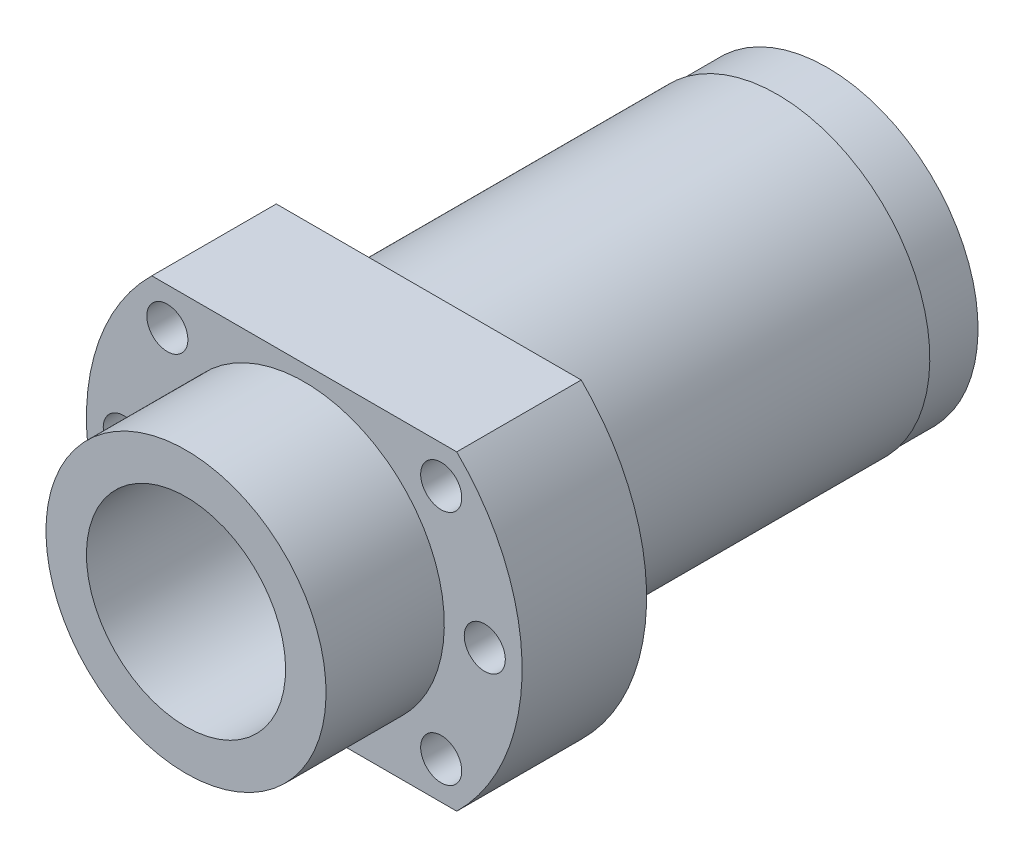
ISO-10303-21;
HEADER;
FILE_DESCRIPTION(('STEP AP214'),'2;1');
FILE_NAME('part.step','',(''),(''),'','','');
FILE_SCHEMA(('AUTOMOTIVE_DESIGN { 1 0 10303 214 1 1 1 1 }'));
ENDSEC;
DATA;
#1=APPLICATION_CONTEXT('core data for automotive mechanical design processes');
#2=APPLICATION_PROTOCOL_DEFINITION('international standard','automotive_design',2000,#1);
#3=PRODUCT_CONTEXT('',#1,'mechanical');
#4=PRODUCT('Part','Part','',(#3));
#5=PRODUCT_RELATED_PRODUCT_CATEGORY('part','',(#4));
#6=PRODUCT_DEFINITION_FORMATION('','',#4);
#7=PRODUCT_DEFINITION_CONTEXT('part definition',#1,'design');
#8=PRODUCT_DEFINITION('design','',#6,#7);
#9=PRODUCT_DEFINITION_SHAPE('','',#8);
#10=(LENGTH_UNIT() NAMED_UNIT(*) SI_UNIT(.MILLI.,.METRE.));
#11=(NAMED_UNIT(*) PLANE_ANGLE_UNIT() SI_UNIT($,.RADIAN.));
#12=(NAMED_UNIT(*) SI_UNIT($,.STERADIAN.) SOLID_ANGLE_UNIT());
#13=UNCERTAINTY_MEASURE_WITH_UNIT(LENGTH_MEASURE(1.E-05),#10,'distance_accuracy_value','');
#14=(GEOMETRIC_REPRESENTATION_CONTEXT(3) GLOBAL_UNCERTAINTY_ASSIGNED_CONTEXT((#13)) GLOBAL_UNIT_ASSIGNED_CONTEXT((#10,
#11,#12)) REPRESENTATION_CONTEXT('',''));
#15=CARTESIAN_POINT('',(0.,0.,0.));
#16=DIRECTION('',(0.,0.,1.));
#17=DIRECTION('',(1.,0.,0.));
#18=AXIS2_PLACEMENT_3D('',#15,#16,#17);
#19=CARTESIAN_POINT('',(29.,0.,20.));
#20=DIRECTION('',(0.,0.,1.));
#21=DIRECTION('',(0.,-1.,0.));
#22=AXIS2_PLACEMENT_3D('',#19,#20,#21);
#23=CYLINDRICAL_SURFACE('',#22,3.3);
#24=CARTESIAN_POINT('',(29.,0.,20.));
#25=DIRECTION('',(0.,0.,1.));
#26=DIRECTION('',(0.,-1.,0.));
#27=AXIS2_PLACEMENT_3D('',#24,#25,#26);
#28=CIRCLE('',#27,3.3);
#29=CARTESIAN_POINT('',(29.,-3.3,20.));
#30=VERTEX_POINT('',#29);
#31=EDGE_CURVE('E298',#30,#30,#28,.T.);
#32=ORIENTED_EDGE('',*,*,#31,.T.);
#33=EDGE_LOOP('',(#32));
#34=FACE_BOUND('',#33,.T.);
#35=CARTESIAN_POINT('',(29.,0.,0.));
#36=DIRECTION('',(0.,0.,-1.));
#37=DIRECTION('',(0.,1.,0.));
#38=AXIS2_PLACEMENT_3D('',#35,#36,#37);
#39=CIRCLE('',#38,3.3);
#40=CARTESIAN_POINT('',(29.,3.3,0.));
#41=VERTEX_POINT('',#40);
#42=EDGE_CURVE('E302',#41,#41,#39,.T.);
#43=ORIENTED_EDGE('',*,*,#42,.T.);
#44=EDGE_LOOP('',(#43));
#45=FACE_BOUND('',#44,.T.);
#46=ADVANCED_FACE('F14',(#34,#45),#23,.F.);
#47=CARTESIAN_POINT('',(22.,-19.,20.));
#48=DIRECTION('',(0.,0.,1.));
#49=DIRECTION('',(0.,-1.,0.));
#50=AXIS2_PLACEMENT_3D('',#47,#48,#49);
#51=CYLINDRICAL_SURFACE('',#50,3.3);
#52=CARTESIAN_POINT('',(22.,-19.,20.));
#53=DIRECTION('',(0.,0.,1.));
#54=DIRECTION('',(0.,-1.,0.));
#55=AXIS2_PLACEMENT_3D('',#52,#53,#54);
#56=CIRCLE('',#55,3.3);
#57=CARTESIAN_POINT('',(22.,-22.3,20.));
#58=VERTEX_POINT('',#57);
#59=EDGE_CURVE('E305',#58,#58,#56,.T.);
#60=ORIENTED_EDGE('',*,*,#59,.T.);
#61=EDGE_LOOP('',(#60));
#62=FACE_BOUND('',#61,.T.);
#63=CARTESIAN_POINT('',(22.,-19.,0.));
#64=DIRECTION('',(0.,0.,-1.));
#65=DIRECTION('',(0.,1.,0.));
#66=AXIS2_PLACEMENT_3D('',#63,#64,#65);
#67=CIRCLE('',#66,3.3);
#68=CARTESIAN_POINT('',(22.,-15.7,0.));
#69=VERTEX_POINT('',#68);
#70=EDGE_CURVE('E308',#69,#69,#67,.T.);
#71=ORIENTED_EDGE('',*,*,#70,.T.);
#72=EDGE_LOOP('',(#71));
#73=FACE_BOUND('',#72,.T.);
#74=ADVANCED_FACE('F364',(#62,#73),#51,.F.);
#75=CARTESIAN_POINT('',(-29.,0.,20.));
#76=DIRECTION('',(0.,0.,1.));
#77=DIRECTION('',(0.,-1.,0.));
#78=AXIS2_PLACEMENT_3D('',#75,#76,#77);
#79=CYLINDRICAL_SURFACE('',#78,3.3);
#80=CARTESIAN_POINT('',(-29.,0.,20.));
#81=DIRECTION('',(0.,0.,1.));
#82=DIRECTION('',(0.,-1.,0.));
#83=AXIS2_PLACEMENT_3D('',#80,#81,#82);
#84=CIRCLE('',#83,3.3);
#85=CARTESIAN_POINT('',(-29.,-3.3,20.));
#86=VERTEX_POINT('',#85);
#87=EDGE_CURVE('E311',#86,#86,#84,.T.);
#88=ORIENTED_EDGE('',*,*,#87,.T.);
#89=EDGE_LOOP('',(#88));
#90=FACE_BOUND('',#89,.T.);
#91=CARTESIAN_POINT('',(-29.,0.,0.));
#92=DIRECTION('',(0.,0.,-1.));
#93=DIRECTION('',(0.,1.,0.));
#94=AXIS2_PLACEMENT_3D('',#91,#92,#93);
#95=CIRCLE('',#94,3.3);
#96=CARTESIAN_POINT('',(-29.,3.3,0.));
#97=VERTEX_POINT('',#96);
#98=EDGE_CURVE('E314',#97,#97,#95,.T.);
#99=ORIENTED_EDGE('',*,*,#98,.T.);
#100=EDGE_LOOP('',(#99));
#101=FACE_BOUND('',#100,.T.);
#102=ADVANCED_FACE('F370',(#90,#101),#79,.F.);
#103=CARTESIAN_POINT('',(-22.,-19.,20.));
#104=DIRECTION('',(0.,0.,1.));
#105=DIRECTION('',(0.,-1.,0.));
#106=AXIS2_PLACEMENT_3D('',#103,#104,#105);
#107=CYLINDRICAL_SURFACE('',#106,3.3);
#108=CARTESIAN_POINT('',(-22.,-19.,20.));
#109=DIRECTION('',(0.,0.,1.));
#110=DIRECTION('',(0.,-1.,0.));
#111=AXIS2_PLACEMENT_3D('',#108,#109,#110);
#112=CIRCLE('',#111,3.3);
#113=CARTESIAN_POINT('',(-22.,-22.3,20.));
#114=VERTEX_POINT('',#113);
#115=EDGE_CURVE('E317',#114,#114,#112,.T.);
#116=ORIENTED_EDGE('',*,*,#115,.T.);
#117=EDGE_LOOP('',(#116));
#118=FACE_BOUND('',#117,.T.);
#119=CARTESIAN_POINT('',(-22.,-19.,0.));
#120=DIRECTION('',(0.,0.,-1.));
#121=DIRECTION('',(0.,1.,0.));
#122=AXIS2_PLACEMENT_3D('',#119,#120,#121);
#123=CIRCLE('',#122,3.3);
#124=CARTESIAN_POINT('',(-22.,-15.7,0.));
#125=VERTEX_POINT('',#124);
#126=EDGE_CURVE('E320',#125,#125,#123,.T.);
#127=ORIENTED_EDGE('',*,*,#126,.T.);
#128=EDGE_LOOP('',(#127));
#129=FACE_BOUND('',#128,.T.);
#130=ADVANCED_FACE('F380',(#118,#129),#107,.F.);
#131=CARTESIAN_POINT('',(-22.,19.,20.));
#132=DIRECTION('',(0.,0.,1.));
#133=DIRECTION('',(0.,-1.,0.));
#134=AXIS2_PLACEMENT_3D('',#131,#132,#133);
#135=CYLINDRICAL_SURFACE('',#134,3.3);
#136=CARTESIAN_POINT('',(-22.,19.,20.));
#137=DIRECTION('',(0.,0.,1.));
#138=DIRECTION('',(0.,-1.,0.));
#139=AXIS2_PLACEMENT_3D('',#136,#137,#138);
#140=CIRCLE('',#139,3.3);
#141=CARTESIAN_POINT('',(-22.,15.7,20.));
#142=VERTEX_POINT('',#141);
#143=EDGE_CURVE('E323',#142,#142,#140,.T.);
#144=ORIENTED_EDGE('',*,*,#143,.T.);
#145=EDGE_LOOP('',(#144));
#146=FACE_BOUND('',#145,.T.);
#147=CARTESIAN_POINT('',(-22.,19.,0.));
#148=DIRECTION('',(0.,0.,-1.));
#149=DIRECTION('',(0.,1.,0.));
#150=AXIS2_PLACEMENT_3D('',#147,#148,#149);
#151=CIRCLE('',#150,3.3);
#152=CARTESIAN_POINT('',(-22.,22.3,0.));
#153=VERTEX_POINT('',#152);
#154=EDGE_CURVE('E326',#153,#153,#151,.T.);
#155=ORIENTED_EDGE('',*,*,#154,.T.);
#156=EDGE_LOOP('',(#155));
#157=FACE_BOUND('',#156,.T.);
#158=ADVANCED_FACE('F357',(#146,#157),#135,.F.);
#159=CARTESIAN_POINT('',(22.,19.,20.));
#160=DIRECTION('',(0.,0.,1.));
#161=DIRECTION('',(0.,-1.,0.));
#162=AXIS2_PLACEMENT_3D('',#159,#160,#161);
#163=CYLINDRICAL_SURFACE('',#162,3.3);
#164=CARTESIAN_POINT('',(22.,19.,20.));
#165=DIRECTION('',(0.,0.,1.));
#166=DIRECTION('',(0.,-1.,0.));
#167=AXIS2_PLACEMENT_3D('',#164,#165,#166);
#168=CIRCLE('',#167,3.3);
#169=CARTESIAN_POINT('',(22.,15.7,20.));
#170=VERTEX_POINT('',#169);
#171=EDGE_CURVE('E329',#170,#170,#168,.T.);
#172=ORIENTED_EDGE('',*,*,#171,.T.);
#173=EDGE_LOOP('',(#172));
#174=FACE_BOUND('',#173,.T.);
#175=CARTESIAN_POINT('',(22.,19.,0.));
#176=DIRECTION('',(0.,0.,-1.));
#177=DIRECTION('',(0.,1.,0.));
#178=AXIS2_PLACEMENT_3D('',#175,#176,#177);
#179=CIRCLE('',#178,3.3);
#180=CARTESIAN_POINT('',(22.,22.3,0.));
#181=VERTEX_POINT('',#180);
#182=EDGE_CURVE('E332',#181,#181,#179,.T.);
#183=ORIENTED_EDGE('',*,*,#182,.T.);
#184=EDGE_LOOP('',(#183));
#185=FACE_BOUND('',#184,.T.);
#186=ADVANCED_FACE('F349',(#174,#185),#163,.F.);
#187=CARTESIAN_POINT('',(0.,0.,63.9092465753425));
#188=DIRECTION('',(0.,0.,1.));
#189=DIRECTION('',(0.,-1.,0.));
#190=AXIS2_PLACEMENT_3D('',#187,#188,#189);
#191=CYLINDRICAL_SURFACE('',#190,35.);
#192=DIRECTION('',(0.,0.,1.));
#193=VECTOR('',#192,1.);
#194=CARTESIAN_POINT('',(24.4948974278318,-25.,-56.001));
#195=LINE('',#194,#193);
#196=CARTESIAN_POINT('',(24.4948974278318,-25.,0.));
#197=VERTEX_POINT('',#196);
#198=CARTESIAN_POINT('',(24.4948974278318,-25.,20.));
#199=VERTEX_POINT('',#198);
#200=EDGE_CURVE('E257',#197,#199,#195,.T.);
#201=ORIENTED_EDGE('',*,*,#200,.F.);
#202=CARTESIAN_POINT('',(0.,0.,0.));
#203=DIRECTION('',(0.,0.,1.));
#204=DIRECTION('',(0.,-1.,0.));
#205=AXIS2_PLACEMENT_3D('',#202,#203,#204);
#206=CIRCLE('',#205,35.);
#207=CARTESIAN_POINT('',(24.4948974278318,25.,0.));
#208=VERTEX_POINT('',#207);
#209=EDGE_CURVE('E242',#197,#208,#206,.T.);
#210=ORIENTED_EDGE('',*,*,#209,.T.);
#211=DIRECTION('',(0.,0.,1.));
#212=VECTOR('',#211,1.);
#213=CARTESIAN_POINT('',(24.4948974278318,25.,-56.001));
#214=LINE('',#213,#212);
#215=CARTESIAN_POINT('',(24.4948974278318,25.,20.));
#216=VERTEX_POINT('',#215);
#217=EDGE_CURVE('E339',#208,#216,#214,.T.);
#218=ORIENTED_EDGE('',*,*,#217,.T.);
#219=CARTESIAN_POINT('',(0.,0.,20.));
#220=DIRECTION('',(0.,0.,1.));
#221=DIRECTION('',(0.,-1.,0.));
#222=AXIS2_PLACEMENT_3D('',#219,#220,#221);
#223=CIRCLE('',#222,35.);
#224=EDGE_CURVE('E270',#199,#216,#223,.T.);
#225=ORIENTED_EDGE('',*,*,#224,.F.);
#226=EDGE_LOOP('',(#201,#210,#218,#225));
#227=FACE_BOUND('',#226,.T.);
#228=ADVANCED_FACE('F347',(#227),#191,.T.);
#229=CARTESIAN_POINT('',(-24.4948974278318,25.,-56.001));
#230=DIRECTION('',(0.,-1.,0.));
#231=DIRECTION('',(1.,0.,0.));
#232=AXIS2_PLACEMENT_3D('',#229,#230,#231);
#233=PLANE('',#232);
#234=DIRECTION('',(0.,0.,1.));
#235=VECTOR('',#234,1.);
#236=CARTESIAN_POINT('',(-24.4948974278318,25.,-56.001));
#237=LINE('',#236,#235);
#238=CARTESIAN_POINT('',(-24.4948974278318,25.,0.));
#239=VERTEX_POINT('',#238);
#240=CARTESIAN_POINT('',(-24.4948974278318,25.,20.));
#241=VERTEX_POINT('',#240);
#242=EDGE_CURVE('E269',#239,#241,#237,.T.);
#243=ORIENTED_EDGE('',*,*,#242,.T.);
#244=DIRECTION('',(1.,0.,0.));
#245=VECTOR('',#244,1.);
#246=CARTESIAN_POINT('',(-24.4948974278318,25.,20.));
#247=LINE('',#246,#245);
#248=EDGE_CURVE('E265',#241,#216,#247,.T.);
#249=ORIENTED_EDGE('',*,*,#248,.T.);
#250=ORIENTED_EDGE('',*,*,#217,.F.);
#251=DIRECTION('',(1.,0.,0.));
#252=VECTOR('',#251,1.);
#253=CARTESIAN_POINT('',(-24.4948974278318,25.,0.));
#254=LINE('',#253,#252);
#255=EDGE_CURVE('E274',#239,#208,#254,.T.);
#256=ORIENTED_EDGE('',*,*,#255,.F.);
#257=EDGE_LOOP('',(#243,#249,#250,#256));
#258=FACE_BOUND('',#257,.T.);
#259=ADVANCED_FACE('F342',(#258),#233,.F.);
#260=DIRECTION('',(0.,0.,1.));
#261=VECTOR('',#260,1.);
#262=CARTESIAN_POINT('',(-24.4948974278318,-25.,-56.001));
#263=LINE('',#262,#261);
#264=CARTESIAN_POINT('',(-24.4948974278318,-25.,0.));
#265=VERTEX_POINT('',#264);
#266=CARTESIAN_POINT('',(-24.4948974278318,-25.,20.));
#267=VERTEX_POINT('',#266);
#268=EDGE_CURVE('E247',#265,#267,#263,.T.);
#269=ORIENTED_EDGE('',*,*,#268,.T.);
#270=EDGE_CURVE('E272',#241,#267,#223,.T.);
#271=ORIENTED_EDGE('',*,*,#270,.F.);
#272=ORIENTED_EDGE('',*,*,#242,.F.);
#273=EDGE_CURVE('E264',#239,#265,#206,.T.);
#274=ORIENTED_EDGE('',*,*,#273,.T.);
#275=EDGE_LOOP('',(#269,#271,#272,#274));
#276=FACE_BOUND('',#275,.T.);
#277=ADVANCED_FACE('F268',(#276),#191,.T.);
#278=CARTESIAN_POINT('',(-24.4948974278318,-25.,-56.001));
#279=DIRECTION('',(0.,1.,0.));
#280=DIRECTION('',(-1.,0.,0.));
#281=AXIS2_PLACEMENT_3D('',#278,#279,#280);
#282=PLANE('',#281);
#283=ORIENTED_EDGE('',*,*,#200,.T.);
#284=DIRECTION('',(-1.,0.,0.));
#285=VECTOR('',#284,1.);
#286=CARTESIAN_POINT('',(-24.4948974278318,-25.,20.));
#287=LINE('',#286,#285);
#288=EDGE_CURVE('E252',#199,#267,#287,.T.);
#289=ORIENTED_EDGE('',*,*,#288,.T.);
#290=ORIENTED_EDGE('',*,*,#268,.F.);
#291=DIRECTION('',(-1.,0.,0.));
#292=VECTOR('',#291,1.);
#293=CARTESIAN_POINT('',(-24.4948974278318,-25.,0.));
#294=LINE('',#293,#292);
#295=EDGE_CURVE('E250',#197,#265,#294,.T.);
#296=ORIENTED_EDGE('',*,*,#295,.F.);
#297=EDGE_LOOP('',(#283,#289,#290,#296));
#298=FACE_BOUND('',#297,.T.);
#299=ADVANCED_FACE('F249',(#298),#282,.F.);
#300=CARTESIAN_POINT('',(-22.5,0.,20.));
#301=DIRECTION('',(0.,0.,1.));
#302=DIRECTION('',(0.,-1.,0.));
#303=AXIS2_PLACEMENT_3D('',#300,#301,#302);
#304=PLANE('',#303);
#305=ORIENTED_EDGE('',*,*,#31,.F.);
#306=EDGE_LOOP('',(#305));
#307=FACE_BOUND('',#306,.T.);
#308=ORIENTED_EDGE('',*,*,#59,.F.);
#309=EDGE_LOOP('',(#308));
#310=FACE_BOUND('',#309,.T.);
#311=ORIENTED_EDGE('',*,*,#87,.F.);
#312=EDGE_LOOP('',(#311));
#313=FACE_BOUND('',#312,.T.);
#314=ORIENTED_EDGE('',*,*,#115,.F.);
#315=EDGE_LOOP('',(#314));
#316=FACE_BOUND('',#315,.T.);
#317=ORIENTED_EDGE('',*,*,#143,.F.);
#318=EDGE_LOOP('',(#317));
#319=FACE_BOUND('',#318,.T.);
#320=ORIENTED_EDGE('',*,*,#171,.F.);
#321=EDGE_LOOP('',(#320));
#322=FACE_BOUND('',#321,.T.);
#323=ORIENTED_EDGE('',*,*,#288,.F.);
#324=ORIENTED_EDGE('',*,*,#224,.T.);
#325=ORIENTED_EDGE('',*,*,#248,.F.);
#326=ORIENTED_EDGE('',*,*,#270,.T.);
#327=EDGE_LOOP('',(#323,#324,#325,#326));
#328=FACE_BOUND('',#327,.T.);
#329=CARTESIAN_POINT('',(0.,0.,20.));
#330=DIRECTION('',(0.,0.,1.));
#331=DIRECTION('',(0.,-1.,0.));
#332=AXIS2_PLACEMENT_3D('',#329,#330,#331);
#333=CIRCLE('',#332,22.5);
#334=CARTESIAN_POINT('',(0.,-22.5,20.));
#335=VERTEX_POINT('',#334);
#336=EDGE_CURVE('E277',#335,#335,#333,.T.);
#337=ORIENTED_EDGE('',*,*,#336,.F.);
#338=EDGE_LOOP('',(#337));
#339=FACE_BOUND('',#338,.T.);
#340=ADVANCED_FACE('F344',(#307,#310,#313,#316,#319,#322,#328,#339),#304,.T.);
#341=CARTESIAN_POINT('',(-35.,0.,0.));
#342=DIRECTION('',(0.,0.,-1.));
#343=DIRECTION('',(0.,1.,0.));
#344=AXIS2_PLACEMENT_3D('',#341,#342,#343);
#345=PLANE('',#344);
#346=ORIENTED_EDGE('',*,*,#295,.T.);
#347=ORIENTED_EDGE('',*,*,#273,.F.);
#348=ORIENTED_EDGE('',*,*,#255,.T.);
#349=ORIENTED_EDGE('',*,*,#209,.F.);
#350=EDGE_LOOP('',(#346,#347,#348,#349));
#351=FACE_BOUND('',#350,.T.);
#352=ORIENTED_EDGE('',*,*,#182,.F.);
#353=EDGE_LOOP('',(#352));
#354=FACE_BOUND('',#353,.T.);
#355=ORIENTED_EDGE('',*,*,#154,.F.);
#356=EDGE_LOOP('',(#355));
#357=FACE_BOUND('',#356,.T.);
#358=ORIENTED_EDGE('',*,*,#126,.F.);
#359=EDGE_LOOP('',(#358));
#360=FACE_BOUND('',#359,.T.);
#361=ORIENTED_EDGE('',*,*,#98,.F.);
#362=EDGE_LOOP('',(#361));
#363=FACE_BOUND('',#362,.T.);
#364=ORIENTED_EDGE('',*,*,#70,.F.);
#365=EDGE_LOOP('',(#364));
#366=FACE_BOUND('',#365,.T.);
#367=ORIENTED_EDGE('',*,*,#42,.F.);
#368=EDGE_LOOP('',(#367));
#369=FACE_BOUND('',#368,.T.);
#370=CARTESIAN_POINT('',(0.,0.,0.));
#371=DIRECTION('',(0.,0.,-1.));
#372=DIRECTION('',(0.886825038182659,-0.462105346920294,0.));
#373=AXIS2_PLACEMENT_3D('',#370,#371,#372);
#374=CIRCLE('',#373,24.5);
#375=CARTESIAN_POINT('',(21.7272134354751,-11.3215809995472,0.));
#376=VERTEX_POINT('',#375);
#377=EDGE_CURVE('E282',#376,#376,#374,.T.);
#378=ORIENTED_EDGE('',*,*,#377,.F.);
#379=EDGE_LOOP('',(#378));
#380=FACE_BOUND('',#379,.T.);
#381=ADVANCED_FACE('F261',(#351,#354,#357,#360,#363,#366,#369,#380),#345,.T.);
#382=CARTESIAN_POINT('',(0.,0.,63.9092465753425));
#383=DIRECTION('',(0.,0.,1.));
#384=DIRECTION('',(0.,-1.,0.));
#385=AXIS2_PLACEMENT_3D('',#382,#383,#384);
#386=CYLINDRICAL_SURFACE('',#385,22.5);
#387=ORIENTED_EDGE('',*,*,#336,.T.);
#388=EDGE_LOOP('',(#387));
#389=FACE_BOUND('',#388,.T.);
#390=CARTESIAN_POINT('',(0.,0.,39.));
#391=DIRECTION('',(0.,0.,1.));
#392=DIRECTION('',(0.,-1.,0.));
#393=AXIS2_PLACEMENT_3D('',#390,#391,#392);
#394=CIRCLE('',#393,22.5);
#395=CARTESIAN_POINT('',(0.,-22.5,39.));
#396=VERTEX_POINT('',#395);
#397=EDGE_CURVE('E18',#396,#396,#394,.T.);
#398=ORIENTED_EDGE('',*,*,#397,.F.);
#399=EDGE_LOOP('',(#398));
#400=FACE_BOUND('',#399,.T.);
#401=ADVANCED_FACE('F390',(#389,#400),#386,.T.);
#402=CARTESIAN_POINT('',(0.,0.,-56.));
#403=DIRECTION('',(0.,0.,1.));
#404=DIRECTION('',(-0.886825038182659,0.462105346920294,0.));
#405=AXIS2_PLACEMENT_3D('',#402,#403,#404);
#406=CYLINDRICAL_SURFACE('',#405,24.5);
#407=CARTESIAN_POINT('',(0.,0.,-56.));
#408=DIRECTION('',(0.,0.,-1.));
#409=DIRECTION('',(0.886825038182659,-0.462105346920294,0.));
#410=AXIS2_PLACEMENT_3D('',#407,#408,#409);
#411=CIRCLE('',#410,24.5);
#412=CARTESIAN_POINT('',(21.7272134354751,-11.3215809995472,-56.));
#413=VERTEX_POINT('',#412);
#414=EDGE_CURVE('E286',#413,#413,#411,.T.);
#415=ORIENTED_EDGE('',*,*,#414,.F.);
#416=EDGE_LOOP('',(#415));
#417=FACE_BOUND('',#416,.T.);
#418=ORIENTED_EDGE('',*,*,#377,.T.);
#419=EDGE_LOOP('',(#418));
#420=FACE_BOUND('',#419,.T.);
#421=ADVANCED_FACE('F395',(#417,#420),#406,.T.);
#422=CARTESIAN_POINT('',(-22.5,0.,39.));
#423=DIRECTION('',(0.,0.,1.));
#424=DIRECTION('',(0.,-1.,0.));
#425=AXIS2_PLACEMENT_3D('',#422,#423,#424);
#426=PLANE('',#425);
#427=CARTESIAN_POINT('',(0.,0.,39.));
#428=DIRECTION('',(0.,0.,1.));
#429=DIRECTION('',(0.,-1.,0.));
#430=AXIS2_PLACEMENT_3D('',#427,#428,#429);
#431=CIRCLE('',#430,16.);
#432=CARTESIAN_POINT('',(0.,-16.,39.));
#433=VERTEX_POINT('',#432);
#434=EDGE_CURVE('E295',#433,#433,#431,.T.);
#435=ORIENTED_EDGE('',*,*,#434,.F.);
#436=EDGE_LOOP('',(#435));
#437=FACE_BOUND('',#436,.T.);
#438=ORIENTED_EDGE('',*,*,#397,.T.);
#439=EDGE_LOOP('',(#438));
#440=FACE_BOUND('',#439,.T.);
#441=ADVANCED_FACE('F16',(#437,#440),#426,.T.);
#442=CARTESIAN_POINT('',(0.,0.,-56.));
#443=DIRECTION('',(0.,0.,-1.));
#444=DIRECTION('',(0.886825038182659,-0.462105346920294,0.));
#445=AXIS2_PLACEMENT_3D('',#442,#443,#444);
#446=PLANE('',#445);
#447=CARTESIAN_POINT('',(0.,0.,-56.));
#448=DIRECTION('',(0.,0.,1.));
#449=DIRECTION('',(0.,1.,0.));
#450=AXIS2_PLACEMENT_3D('',#447,#448,#449);
#451=CIRCLE('',#450,24.25);
#452=CARTESIAN_POINT('',(0.,24.25,-56.));
#453=VERTEX_POINT('',#452);
#454=EDGE_CURVE('E1231',#453,#453,#451,.T.);
#455=ORIENTED_EDGE('',*,*,#454,.T.);
#456=EDGE_LOOP('',(#455));
#457=FACE_BOUND('',#456,.T.);
#458=ORIENTED_EDGE('',*,*,#414,.T.);
#459=EDGE_LOOP('',(#458));
#460=FACE_BOUND('',#459,.T.);
#461=ADVANCED_FACE('F1036',(#457,#460),#446,.T.);
#462=CARTESIAN_POINT('',(0.,0.,56.3419569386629));
#463=DIRECTION('',(0.,0.,1.));
#464=DIRECTION('',(0.,-1.,0.));
#465=AXIS2_PLACEMENT_3D('',#462,#463,#464);
#466=CYLINDRICAL_SURFACE('',#465,16.);
#467=CARTESIAN_POINT('',(0.,0.,-54.));
#468=DIRECTION('',(0.,0.,1.));
#469=DIRECTION('',(0.,1.,0.));
#470=AXIS2_PLACEMENT_3D('',#467,#468,#469);
#471=CIRCLE('',#470,16.);
#472=CARTESIAN_POINT('',(0.,16.,-54.));
#473=VERTEX_POINT('',#472);
#474=EDGE_CURVE('E1226',#473,#473,#471,.T.);
#475=ORIENTED_EDGE('',*,*,#474,.F.);
#476=EDGE_LOOP('',(#475));
#477=FACE_BOUND('',#476,.T.);
#478=ORIENTED_EDGE('',*,*,#434,.T.);
#479=EDGE_LOOP('',(#478));
#480=FACE_BOUND('',#479,.T.);
#481=ADVANCED_FACE('F375',(#477,#480),#466,.F.);
#482=CARTESIAN_POINT('',(0.,0.,-54.));
#483=DIRECTION('',(0.,0.,1.));
#484=DIRECTION('',(0.,1.,0.));
#485=AXIS2_PLACEMENT_3D('',#482,#483,#484);
#486=PLANE('',#485);
#487=ORIENTED_EDGE('',*,*,#474,.T.);
#488=EDGE_LOOP('',(#487));
#489=FACE_BOUND('',#488,.T.);
#490=ADVANCED_FACE('F1062',(#489),#486,.T.);
#491=CARTESIAN_POINT('',(0.,0.,-62.));
#492=DIRECTION('',(0.,0.,-1.));
#493=DIRECTION('',(0.,-1.,0.));
#494=AXIS2_PLACEMENT_3D('',#491,#492,#493);
#495=PLANE('',#494);
#496=CARTESIAN_POINT('',(0.,0.,-62.));
#497=DIRECTION('',(0.,0.,-1.));
#498=DIRECTION('',(0.,-1.,0.));
#499=AXIS2_PLACEMENT_3D('',#496,#497,#498);
#500=CIRCLE('',#499,7.);
#501=CARTESIAN_POINT('',(0.,-7.,-62.));
#502=VERTEX_POINT('',#501);
#503=EDGE_CURVE('E1561',#502,#502,#500,.T.);
#504=ORIENTED_EDGE('',*,*,#503,.T.);
#505=EDGE_LOOP('',(#504));
#506=FACE_BOUND('',#505,.T.);
#507=ADVANCED_FACE('F1094',(#506),#495,.T.);
#508=CARTESIAN_POINT('',(0.,0.,-56.));
#509=DIRECTION('',(0.,0.,-1.));
#510=DIRECTION('',(0.,-1.,0.));
#511=AXIS2_PLACEMENT_3D('',#508,#509,#510);
#512=CYLINDRICAL_SURFACE('',#511,24.25);
#513=ORIENTED_EDGE('',*,*,#454,.F.);
#514=EDGE_LOOP('',(#513));
#515=FACE_BOUND('',#514,.T.);
#516=CARTESIAN_POINT('',(0.,0.,-64.));
#517=DIRECTION('',(0.,0.,1.));
#518=DIRECTION('',(0.,1.,0.));
#519=AXIS2_PLACEMENT_3D('',#516,#517,#518);
#520=CIRCLE('',#519,24.25);
#521=CARTESIAN_POINT('',(0.,24.25,-64.));
#522=VERTEX_POINT('',#521);
#523=EDGE_CURVE('E1227',#522,#522,#520,.T.);
#524=ORIENTED_EDGE('',*,*,#523,.T.);
#525=EDGE_LOOP('',(#524));
#526=FACE_BOUND('',#525,.T.);
#527=ADVANCED_FACE('F1089',(#515,#526),#512,.T.);
#528=CARTESIAN_POINT('',(-16.4544826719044,-9.5,-64.));
#529=DIRECTION('',(0.,0.,-1.));
#530=DIRECTION('',(0.,-1.,0.));
#531=AXIS2_PLACEMENT_3D('',#528,#529,#530);
#532=CYLINDRICAL_SURFACE('',#531,4.);
#533=CARTESIAN_POINT('',(-16.4544826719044,-9.5,-63.5));
#534=DIRECTION('',(0.,0.,-1.));
#535=DIRECTION('',(-1.,0.,0.));
#536=AXIS2_PLACEMENT_3D('',#533,#534,#535);
#537=CIRCLE('',#536,4.);
#538=CARTESIAN_POINT('',(-20.4544826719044,-9.5,-63.5));
#539=VERTEX_POINT('',#538);
#540=EDGE_CURVE('E1249',#539,#539,#537,.F.);
#541=ORIENTED_EDGE('',*,*,#540,.T.);
#542=EDGE_LOOP('',(#541));
#543=FACE_BOUND('',#542,.T.);
#544=CARTESIAN_POINT('',(-16.4544826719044,-9.5,-64.));
#545=DIRECTION('',(0.,0.,-1.));
#546=DIRECTION('',(0.,-1.,0.));
#547=AXIS2_PLACEMENT_3D('',#544,#545,#546);
#548=CIRCLE('',#547,4.);
#549=CARTESIAN_POINT('',(-16.4544826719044,-13.5,-64.));
#550=VERTEX_POINT('',#549);
#551=EDGE_CURVE('E1228',#550,#550,#548,.T.);
#552=ORIENTED_EDGE('',*,*,#551,.T.);
#553=EDGE_LOOP('',(#552));
#554=FACE_BOUND('',#553,.T.);
#555=ADVANCED_FACE('F866',(#543,#554),#532,.F.);
#556=CARTESIAN_POINT('',(0.,19.,-64.));
#557=DIRECTION('',(0.,0.,-1.));
#558=DIRECTION('',(0.,-1.,0.));
#559=AXIS2_PLACEMENT_3D('',#556,#557,#558);
#560=CYLINDRICAL_SURFACE('',#559,4.);
#561=CARTESIAN_POINT('',(0.,19.,-63.5));
#562=DIRECTION('',(0.,0.,-1.));
#563=DIRECTION('',(-1.,0.,0.));
#564=AXIS2_PLACEMENT_3D('',#561,#562,#563);
#565=CIRCLE('',#564,4.);
#566=CARTESIAN_POINT('',(-4.,19.,-63.5));
#567=VERTEX_POINT('',#566);
#568=EDGE_CURVE('E1246',#567,#567,#565,.F.);
#569=ORIENTED_EDGE('',*,*,#568,.T.);
#570=EDGE_LOOP('',(#569));
#571=FACE_BOUND('',#570,.T.);
#572=CARTESIAN_POINT('',(0.,19.,-64.));
#573=DIRECTION('',(0.,0.,-1.));
#574=DIRECTION('',(0.,-1.,0.));
#575=AXIS2_PLACEMENT_3D('',#572,#573,#574);
#576=CIRCLE('',#575,4.);
#577=CARTESIAN_POINT('',(0.,15.,-64.));
#578=VERTEX_POINT('',#577);
#579=EDGE_CURVE('E1573',#578,#578,#576,.T.);
#580=ORIENTED_EDGE('',*,*,#579,.T.);
#581=EDGE_LOOP('',(#580));
#582=FACE_BOUND('',#581,.T.);
#583=ADVANCED_FACE('F1104',(#571,#582),#560,.F.);
#584=CARTESIAN_POINT('',(16.4544826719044,9.5,-64.));
#585=DIRECTION('',(0.,0.,-1.));
#586=DIRECTION('',(0.,-1.,0.));
#587=AXIS2_PLACEMENT_3D('',#584,#585,#586);
#588=CYLINDRICAL_SURFACE('',#587,4.);
#589=CARTESIAN_POINT('',(16.4544826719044,9.5,-63.5));
#590=DIRECTION('',(0.,0.,-1.));
#591=DIRECTION('',(0.,-1.,0.));
#592=AXIS2_PLACEMENT_3D('',#589,#590,#591);
#593=CIRCLE('',#592,4.);
#594=CARTESIAN_POINT('',(16.4544826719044,5.5,-63.5));
#595=VERTEX_POINT('',#594);
#596=EDGE_CURVE('E1252',#595,#595,#593,.T.);
#597=ORIENTED_EDGE('',*,*,#596,.F.);
#598=EDGE_LOOP('',(#597));
#599=FACE_BOUND('',#598,.T.);
#600=CARTESIAN_POINT('',(16.4544826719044,9.5,-64.));
#601=DIRECTION('',(0.,0.,-1.));
#602=DIRECTION('',(0.,-1.,0.));
#603=AXIS2_PLACEMENT_3D('',#600,#601,#602);
#604=CIRCLE('',#603,4.);
#605=CARTESIAN_POINT('',(16.4544826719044,5.5,-64.));
#606=VERTEX_POINT('',#605);
#607=EDGE_CURVE('E1564',#606,#606,#604,.T.);
#608=ORIENTED_EDGE('',*,*,#607,.T.);
#609=EDGE_LOOP('',(#608));
#610=FACE_BOUND('',#609,.T.);
#611=ADVANCED_FACE('F1122',(#599,#610),#588,.F.);
#612=CARTESIAN_POINT('',(16.4544826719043,-9.5,-64.));
#613=DIRECTION('',(0.,0.,-1.));
#614=DIRECTION('',(0.,-1.,0.));
#615=AXIS2_PLACEMENT_3D('',#612,#613,#614);
#616=CYLINDRICAL_SURFACE('',#615,4.);
#617=CARTESIAN_POINT('',(16.4544826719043,-9.5,-63.5));
#618=DIRECTION('',(0.,0.,-1.));
#619=DIRECTION('',(-1.,0.,0.));
#620=AXIS2_PLACEMENT_3D('',#617,#618,#619);
#621=CIRCLE('',#620,4.);
#622=CARTESIAN_POINT('',(12.4544826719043,-9.5,-63.5));
#623=VERTEX_POINT('',#622);
#624=EDGE_CURVE('E1243',#623,#623,#621,.F.);
#625=ORIENTED_EDGE('',*,*,#624,.T.);
#626=EDGE_LOOP('',(#625));
#627=FACE_BOUND('',#626,.T.);
#628=CARTESIAN_POINT('',(16.4544826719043,-9.5,-64.));
#629=DIRECTION('',(0.,0.,-1.));
#630=DIRECTION('',(0.,-1.,0.));
#631=AXIS2_PLACEMENT_3D('',#628,#629,#630);
#632=CIRCLE('',#631,4.);
#633=CARTESIAN_POINT('',(16.4544826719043,-13.5,-64.));
#634=VERTEX_POINT('',#633);
#635=EDGE_CURVE('E1560',#634,#634,#632,.T.);
#636=ORIENTED_EDGE('',*,*,#635,.T.);
#637=EDGE_LOOP('',(#636));
#638=FACE_BOUND('',#637,.T.);
#639=ADVANCED_FACE('F1073',(#627,#638),#616,.F.);
#640=CARTESIAN_POINT('',(0.,-19.,-64.));
#641=DIRECTION('',(0.,0.,-1.));
#642=DIRECTION('',(0.,-1.,0.));
#643=AXIS2_PLACEMENT_3D('',#640,#641,#642);
#644=CYLINDRICAL_SURFACE('',#643,4.);
#645=CARTESIAN_POINT('',(0.,-19.,-63.5));
#646=DIRECTION('',(0.,0.,-1.));
#647=DIRECTION('',(-1.,0.,0.));
#648=AXIS2_PLACEMENT_3D('',#645,#646,#647);
#649=CIRCLE('',#648,4.);
#650=CARTESIAN_POINT('',(-4.00000000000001,-19.,-63.5));
#651=VERTEX_POINT('',#650);
#652=EDGE_CURVE('E1239',#651,#651,#649,.F.);
#653=ORIENTED_EDGE('',*,*,#652,.T.);
#654=EDGE_LOOP('',(#653));
#655=FACE_BOUND('',#654,.T.);
#656=CARTESIAN_POINT('',(0.,-19.,-64.));
#657=DIRECTION('',(0.,0.,-1.));
#658=DIRECTION('',(0.,-1.,0.));
#659=AXIS2_PLACEMENT_3D('',#656,#657,#658);
#660=CIRCLE('',#659,4.);
#661=CARTESIAN_POINT('',(0.,-23.,-64.));
#662=VERTEX_POINT('',#661);
#663=EDGE_CURVE('E1558',#662,#662,#660,.T.);
#664=ORIENTED_EDGE('',*,*,#663,.T.);
#665=EDGE_LOOP('',(#664));
#666=FACE_BOUND('',#665,.T.);
#667=ADVANCED_FACE('F1067',(#655,#666),#644,.F.);
#668=CARTESIAN_POINT('',(0.,0.,-62.));
#669=DIRECTION('',(0.,0.,-1.));
#670=DIRECTION('',(0.,-1.,0.));
#671=AXIS2_PLACEMENT_3D('',#668,#669,#670);
#672=CYLINDRICAL_SURFACE('',#671,7.);
#673=ORIENTED_EDGE('',*,*,#503,.F.);
#674=EDGE_LOOP('',(#673));
#675=FACE_BOUND('',#674,.T.);
#676=CARTESIAN_POINT('',(0.,0.,-64.));
#677=DIRECTION('',(0.,0.,-1.));
#678=DIRECTION('',(0.,-1.,0.));
#679=AXIS2_PLACEMENT_3D('',#676,#677,#678);
#680=CIRCLE('',#679,7.);
#681=CARTESIAN_POINT('',(0.,-7.,-64.));
#682=VERTEX_POINT('',#681);
#683=EDGE_CURVE('E1567',#682,#682,#680,.T.);
#684=ORIENTED_EDGE('',*,*,#683,.T.);
#685=EDGE_LOOP('',(#684));
#686=FACE_BOUND('',#685,.T.);
#687=ADVANCED_FACE('F1072',(#675,#686),#672,.F.);
#688=CARTESIAN_POINT('',(0.,0.,-64.));
#689=DIRECTION('',(0.,0.,1.));
#690=DIRECTION('',(0.,1.,0.));
#691=AXIS2_PLACEMENT_3D('',#688,#689,#690);
#692=PLANE('',#691);
#693=ORIENTED_EDGE('',*,*,#683,.F.);
#694=EDGE_LOOP('',(#693));
#695=FACE_BOUND('',#694,.T.);
#696=ORIENTED_EDGE('',*,*,#663,.F.);
#697=EDGE_LOOP('',(#696));
#698=FACE_BOUND('',#697,.T.);
#699=ORIENTED_EDGE('',*,*,#635,.F.);
#700=EDGE_LOOP('',(#699));
#701=FACE_BOUND('',#700,.T.);
#702=ORIENTED_EDGE('',*,*,#607,.F.);
#703=EDGE_LOOP('',(#702));
#704=FACE_BOUND('',#703,.T.);
#705=ORIENTED_EDGE('',*,*,#579,.F.);
#706=EDGE_LOOP('',(#705));
#707=FACE_BOUND('',#706,.T.);
#708=CARTESIAN_POINT('',(-16.4544826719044,9.5,-64.));
#709=DIRECTION('',(0.,0.,-1.));
#710=DIRECTION('',(0.,-1.,0.));
#711=AXIS2_PLACEMENT_3D('',#708,#709,#710);
#712=CIRCLE('',#711,4.);
#713=CARTESIAN_POINT('',(-16.4544826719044,5.5,-64.));
#714=VERTEX_POINT('',#713);
#715=EDGE_CURVE('E1234',#714,#714,#712,.T.);
#716=ORIENTED_EDGE('',*,*,#715,.F.);
#717=EDGE_LOOP('',(#716));
#718=FACE_BOUND('',#717,.T.);
#719=ORIENTED_EDGE('',*,*,#551,.F.);
#720=EDGE_LOOP('',(#719));
#721=FACE_BOUND('',#720,.T.);
#722=ORIENTED_EDGE('',*,*,#523,.F.);
#723=EDGE_LOOP('',(#722));
#724=FACE_BOUND('',#723,.T.);
#725=ADVANCED_FACE('F1076',(#695,#698,#701,#704,#707,#718,#721,#724),#692,.F.);
#726=CARTESIAN_POINT('',(-16.4544826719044,9.5,-64.));
#727=DIRECTION('',(0.,0.,-1.));
#728=DIRECTION('',(0.,-1.,0.));
#729=AXIS2_PLACEMENT_3D('',#726,#727,#728);
#730=CYLINDRICAL_SURFACE('',#729,4.);
#731=CARTESIAN_POINT('',(-16.4544826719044,9.5,-63.5));
#732=DIRECTION('',(0.,0.,-1.));
#733=DIRECTION('',(0.,-1.,0.));
#734=AXIS2_PLACEMENT_3D('',#731,#732,#733);
#735=CIRCLE('',#734,4.);
#736=CARTESIAN_POINT('',(-16.4544826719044,5.5,-63.5));
#737=VERTEX_POINT('',#736);
#738=EDGE_CURVE('E299',#737,#737,#735,.T.);
#739=ORIENTED_EDGE('',*,*,#738,.F.);
#740=EDGE_LOOP('',(#739));
#741=FACE_BOUND('',#740,.T.);
#742=ORIENTED_EDGE('',*,*,#715,.T.);
#743=EDGE_LOOP('',(#742));
#744=FACE_BOUND('',#743,.T.);
#745=ADVANCED_FACE('F863',(#741,#744),#730,.F.);
#746=CARTESIAN_POINT('',(0.0546963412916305,17.2688130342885,-61.5));
#747=DIRECTION('',(0.,0.,-1.));
#748=DIRECTION('',(0.527098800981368,-0.849804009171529,0.));
#749=AXIS2_PLACEMENT_3D('',#746,#747,#748);
#750=PLANE('',#749);
#751=DIRECTION('',(0.88138295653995,-0.472402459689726,0.));
#752=VECTOR('',#751,1.);
#753=CARTESIAN_POINT('',(-1.47190372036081,18.0870380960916,-61.5));
#754=LINE('',#753,#752);
#755=CARTESIAN_POINT('',(-1.47190372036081,18.0870380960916,-61.5));
#756=VERTEX_POINT('',#755);
#757=CARTESIAN_POINT('',(0.0546963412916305,17.2688130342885,-61.5));
#758=VERTEX_POINT('',#757);
#759=EDGE_CURVE('E1304',#756,#758,#754,.T.);
#760=ORIENTED_EDGE('',*,*,#759,.F.);
#761=DIRECTION('',(-0.0315789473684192,0.999501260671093,0.));
#762=VECTOR('',#761,1.);
#763=CARTESIAN_POINT('',(-1.47190372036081,18.0870380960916,-61.5));
#764=LINE('',#763,#762);
#765=CARTESIAN_POINT('',(-1.52660006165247,19.8182250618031,-61.5));
#766=VERTEX_POINT('',#765);
#767=EDGE_CURVE('E1321',#756,#766,#764,.T.);
#768=ORIENTED_EDGE('',*,*,#767,.T.);
#769=DIRECTION('',(0.849804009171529,0.527098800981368,0.));
#770=VECTOR('',#769,1.);
#771=CARTESIAN_POINT('',(-1.52660006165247,19.8182250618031,-61.5));
#772=LINE('',#771,#770);
#773=CARTESIAN_POINT('',(-0.0546963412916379,20.7311869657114,-61.5));
#774=VERTEX_POINT('',#773);
#775=EDGE_CURVE('E1325',#766,#774,#772,.T.);
#776=ORIENTED_EDGE('',*,*,#775,.T.);
#777=DIRECTION('',(-0.88138295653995,0.472402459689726,0.));
#778=VECTOR('',#777,1.);
#779=CARTESIAN_POINT('',(1.47190372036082,19.9129619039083,-61.5));
#780=LINE('',#779,#778);
#781=CARTESIAN_POINT('',(1.47190372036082,19.9129619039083,-61.5));
#782=VERTEX_POINT('',#781);
#783=EDGE_CURVE('E1328',#782,#774,#780,.T.);
#784=ORIENTED_EDGE('',*,*,#783,.F.);
#785=DIRECTION('',(0.0315789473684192,-0.999501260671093,0.));
#786=VECTOR('',#785,1.);
#787=CARTESIAN_POINT('',(1.47190372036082,19.9129619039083,-61.5));
#788=LINE('',#787,#786);
#789=CARTESIAN_POINT('',(1.52660006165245,18.1817749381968,-61.5));
#790=VERTEX_POINT('',#789);
#791=EDGE_CURVE('E1331',#782,#790,#788,.T.);
#792=ORIENTED_EDGE('',*,*,#791,.T.);
#793=DIRECTION('',(-0.849804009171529,-0.527098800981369,0.));
#794=VECTOR('',#793,1.);
#795=CARTESIAN_POINT('',(1.52660006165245,18.1817749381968,-61.5));
#796=LINE('',#795,#794);
#797=EDGE_CURVE('E1334',#790,#758,#796,.T.);
#798=ORIENTED_EDGE('',*,*,#797,.T.);
#799=EDGE_LOOP('',(#760,#768,#776,#784,#792,#798));
#800=FACE_BOUND('',#799,.T.);
#801=ADVANCED_FACE('F571',(#800),#750,.T.);
#802=CARTESIAN_POINT('',(-1.52660006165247,19.8182250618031,-61.5));
#803=DIRECTION('',(-0.527098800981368,0.849804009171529,0.));
#804=DIRECTION('',(0.849804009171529,0.527098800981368,0.));
#805=AXIS2_PLACEMENT_3D('',#802,#803,#804);
#806=PLANE('',#805);
#807=DIRECTION('',(0.,0.,-1.));
#808=VECTOR('',#807,1.);
#809=CARTESIAN_POINT('',(-1.52660006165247,19.8182250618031,-61.5));
#810=LINE('',#809,#808);
#811=CARTESIAN_POINT('',(-1.52660006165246,19.8182250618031,-63.5));
#812=VERTEX_POINT('',#811);
#813=EDGE_CURVE('E1341',#766,#812,#810,.T.);
#814=ORIENTED_EDGE('',*,*,#813,.T.);
#815=DIRECTION('',(0.849804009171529,0.527098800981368,0.));
#816=VECTOR('',#815,1.);
#817=CARTESIAN_POINT('',(-1.52660006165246,19.8182250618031,-63.5));
#818=LINE('',#817,#816);
#819=CARTESIAN_POINT('',(-0.0546963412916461,20.7311869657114,-63.5));
#820=VERTEX_POINT('',#819);
#821=EDGE_CURVE('E1305',#812,#820,#818,.T.);
#822=ORIENTED_EDGE('',*,*,#821,.T.);
#823=DIRECTION('',(0.,0.,-1.));
#824=VECTOR('',#823,1.);
#825=CARTESIAN_POINT('',(-0.0546963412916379,20.7311869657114,-61.5));
#826=LINE('',#825,#824);
#827=EDGE_CURVE('E1343',#774,#820,#826,.T.);
#828=ORIENTED_EDGE('',*,*,#827,.F.);
#829=ORIENTED_EDGE('',*,*,#775,.F.);
#830=EDGE_LOOP('',(#814,#822,#828,#829));
#831=FACE_BOUND('',#830,.T.);
#832=ADVANCED_FACE('F561',(#831),#806,.F.);
#833=CARTESIAN_POINT('',(1.47190372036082,19.9129619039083,-61.5));
#834=DIRECTION('',(-0.472402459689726,-0.88138295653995,0.));
#835=DIRECTION('',(-0.88138295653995,0.472402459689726,0.));
#836=AXIS2_PLACEMENT_3D('',#833,#834,#835);
#837=PLANE('',#836);
#838=ORIENTED_EDGE('',*,*,#827,.T.);
#839=DIRECTION('',(-0.88138295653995,0.472402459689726,0.));
#840=VECTOR('',#839,1.);
#841=CARTESIAN_POINT('',(1.47190372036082,19.9129619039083,-63.5));
#842=LINE('',#841,#840);
#843=CARTESIAN_POINT('',(1.47190372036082,19.9129619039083,-63.5));
#844=VERTEX_POINT('',#843);
#845=EDGE_CURVE('E1308',#844,#820,#842,.T.);
#846=ORIENTED_EDGE('',*,*,#845,.F.);
#847=DIRECTION('',(0.,0.,-1.));
#848=VECTOR('',#847,1.);
#849=CARTESIAN_POINT('',(1.47190372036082,19.9129619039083,-61.5));
#850=LINE('',#849,#848);
#851=EDGE_CURVE('E1345',#782,#844,#850,.T.);
#852=ORIENTED_EDGE('',*,*,#851,.F.);
#853=ORIENTED_EDGE('',*,*,#783,.T.);
#854=EDGE_LOOP('',(#838,#846,#852,#853));
#855=FACE_BOUND('',#854,.T.);
#856=ADVANCED_FACE('F550',(#855),#837,.T.);
#857=CARTESIAN_POINT('',(1.47190372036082,19.9129619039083,-61.5));
#858=DIRECTION('',(0.999501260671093,0.0315789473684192,0.));
#859=DIRECTION('',(0.0315789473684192,-0.999501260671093,0.));
#860=AXIS2_PLACEMENT_3D('',#857,#858,#859);
#861=PLANE('',#860);
#862=ORIENTED_EDGE('',*,*,#851,.T.);
#863=DIRECTION('',(0.0315789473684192,-0.999501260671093,0.));
#864=VECTOR('',#863,1.);
#865=CARTESIAN_POINT('',(1.47190372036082,19.9129619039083,-63.5));
#866=LINE('',#865,#864);
#867=CARTESIAN_POINT('',(1.52660006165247,18.1817749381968,-63.5));
#868=VERTEX_POINT('',#867);
#869=EDGE_CURVE('E1311',#844,#868,#866,.T.);
#870=ORIENTED_EDGE('',*,*,#869,.T.);
#871=DIRECTION('',(0.,0.,-1.));
#872=VECTOR('',#871,1.);
#873=CARTESIAN_POINT('',(1.52660006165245,18.1817749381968,-61.5));
#874=LINE('',#873,#872);
#875=EDGE_CURVE('E1347',#790,#868,#874,.T.);
#876=ORIENTED_EDGE('',*,*,#875,.F.);
#877=ORIENTED_EDGE('',*,*,#791,.F.);
#878=EDGE_LOOP('',(#862,#870,#876,#877));
#879=FACE_BOUND('',#878,.T.);
#880=ADVANCED_FACE('F539',(#879),#861,.F.);
#881=CARTESIAN_POINT('',(1.52660006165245,18.1817749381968,-61.5));
#882=DIRECTION('',(0.527098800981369,-0.849804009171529,0.));
#883=DIRECTION('',(-0.849804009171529,-0.527098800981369,0.));
#884=AXIS2_PLACEMENT_3D('',#881,#882,#883);
#885=PLANE('',#884);
#886=ORIENTED_EDGE('',*,*,#875,.T.);
#887=DIRECTION('',(-0.849804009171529,-0.527098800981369,0.));
#888=VECTOR('',#887,1.);
#889=CARTESIAN_POINT('',(1.52660006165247,18.1817749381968,-63.5));
#890=LINE('',#889,#888);
#891=CARTESIAN_POINT('',(0.0546963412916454,17.2688130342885,-63.5));
#892=VERTEX_POINT('',#891);
#893=EDGE_CURVE('E1314',#868,#892,#890,.T.);
#894=ORIENTED_EDGE('',*,*,#893,.T.);
#895=DIRECTION('',(0.,0.,-1.));
#896=VECTOR('',#895,1.);
#897=CARTESIAN_POINT('',(0.0546963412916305,17.2688130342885,-61.5));
#898=LINE('',#897,#896);
#899=EDGE_CURVE('E1270',#758,#892,#898,.T.);
#900=ORIENTED_EDGE('',*,*,#899,.F.);
#901=ORIENTED_EDGE('',*,*,#797,.F.);
#902=EDGE_LOOP('',(#886,#894,#900,#901));
#903=FACE_BOUND('',#902,.T.);
#904=ADVANCED_FACE('F527',(#903),#885,.F.);
#905=CARTESIAN_POINT('',(-1.47190372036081,18.0870380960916,-61.5));
#906=DIRECTION('',(0.472402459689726,0.88138295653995,0.));
#907=DIRECTION('',(0.88138295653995,-0.472402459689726,0.));
#908=AXIS2_PLACEMENT_3D('',#905,#906,#907);
#909=PLANE('',#908);
#910=ORIENTED_EDGE('',*,*,#899,.T.);
#911=DIRECTION('',(0.88138295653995,-0.472402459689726,0.));
#912=VECTOR('',#911,1.);
#913=CARTESIAN_POINT('',(-1.47190372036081,18.0870380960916,-63.5));
#914=LINE('',#913,#912);
#915=CARTESIAN_POINT('',(-1.47190372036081,18.0870380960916,-63.5));
#916=VERTEX_POINT('',#915);
#917=EDGE_CURVE('E1317',#916,#892,#914,.T.);
#918=ORIENTED_EDGE('',*,*,#917,.F.);
#919=DIRECTION('',(0.,0.,-1.));
#920=VECTOR('',#919,1.);
#921=CARTESIAN_POINT('',(-1.47190372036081,18.0870380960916,-61.5));
#922=LINE('',#921,#920);
#923=EDGE_CURVE('E1324',#756,#916,#922,.T.);
#924=ORIENTED_EDGE('',*,*,#923,.F.);
#925=ORIENTED_EDGE('',*,*,#759,.T.);
#926=EDGE_LOOP('',(#910,#918,#924,#925));
#927=FACE_BOUND('',#926,.T.);
#928=ADVANCED_FACE('F512',(#927),#909,.T.);
#929=CARTESIAN_POINT('',(-1.47190372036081,18.0870380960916,-61.5));
#930=DIRECTION('',(-0.999501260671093,-0.0315789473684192,0.));
#931=DIRECTION('',(-0.0315789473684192,0.999501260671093,0.));
#932=AXIS2_PLACEMENT_3D('',#929,#930,#931);
#933=PLANE('',#932);
#934=ORIENTED_EDGE('',*,*,#767,.F.);
#935=ORIENTED_EDGE('',*,*,#923,.T.);
#936=DIRECTION('',(-0.0315789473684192,0.999501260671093,0.));
#937=VECTOR('',#936,1.);
#938=CARTESIAN_POINT('',(-1.47190372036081,18.0870380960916,-63.5));
#939=LINE('',#938,#937);
#940=EDGE_CURVE('E1301',#916,#812,#939,.T.);
#941=ORIENTED_EDGE('',*,*,#940,.T.);
#942=ORIENTED_EDGE('',*,*,#813,.F.);
#943=EDGE_LOOP('',(#934,#935,#941,#942));
#944=FACE_BOUND('',#943,.T.);
#945=ADVANCED_FACE('F505',(#944),#933,.F.);
#946=CARTESIAN_POINT('',(0.,19.,-63.5));
#947=DIRECTION('',(0.,0.,-1.));
#948=DIRECTION('',(0.527098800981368,-0.849804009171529,0.));
#949=AXIS2_PLACEMENT_3D('',#946,#947,#948);
#950=PLANE('',#949);
#951=ORIENTED_EDGE('',*,*,#940,.F.);
#952=ORIENTED_EDGE('',*,*,#917,.T.);
#953=ORIENTED_EDGE('',*,*,#893,.F.);
#954=ORIENTED_EDGE('',*,*,#869,.F.);
#955=ORIENTED_EDGE('',*,*,#845,.T.);
#956=ORIENTED_EDGE('',*,*,#821,.F.);
#957=EDGE_LOOP('',(#951,#952,#953,#954,#955,#956));
#958=FACE_BOUND('',#957,.T.);
#959=ORIENTED_EDGE('',*,*,#568,.F.);
#960=EDGE_LOOP('',(#959));
#961=FACE_BOUND('',#960,.T.);
#962=ADVANCED_FACE('F511',(#958,#961),#950,.T.);
#963=CARTESIAN_POINT('',(16.509179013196,7.76881303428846,-61.5));
#964=DIRECTION('',(0.,0.,-1.));
#965=DIRECTION('',(0.527098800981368,-0.849804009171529,0.));
#966=AXIS2_PLACEMENT_3D('',#963,#964,#965);
#967=PLANE('',#966);
#968=DIRECTION('',(0.88138295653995,-0.472402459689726,0.));
#969=VECTOR('',#968,1.);
#970=CARTESIAN_POINT('',(14.9825789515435,8.58703809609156,-61.5));
#971=LINE('',#970,#969);
#972=CARTESIAN_POINT('',(14.9825789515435,8.58703809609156,-61.5));
#973=VERTEX_POINT('',#972);
#974=CARTESIAN_POINT('',(16.509179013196,7.76881303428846,-61.5));
#975=VERTEX_POINT('',#974);
#976=EDGE_CURVE('E1353',#973,#975,#971,.T.);
#977=ORIENTED_EDGE('',*,*,#976,.F.);
#978=DIRECTION('',(-0.0315789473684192,0.999501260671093,0.));
#979=VECTOR('',#978,1.);
#980=CARTESIAN_POINT('',(14.9825789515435,8.58703809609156,-61.5));
#981=LINE('',#980,#979);
#982=CARTESIAN_POINT('',(14.9278826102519,10.318225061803,-61.5));
#983=VERTEX_POINT('',#982);
#984=EDGE_CURVE('E1370',#973,#983,#981,.T.);
#985=ORIENTED_EDGE('',*,*,#984,.T.);
#986=DIRECTION('',(0.849804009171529,0.527098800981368,0.));
#987=VECTOR('',#986,1.);
#988=CARTESIAN_POINT('',(14.9278826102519,10.318225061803,-61.5));
#989=LINE('',#988,#987);
#990=CARTESIAN_POINT('',(16.3997863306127,11.2311869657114,-61.5));
#991=VERTEX_POINT('',#990);
#992=EDGE_CURVE('E1374',#983,#991,#989,.T.);
#993=ORIENTED_EDGE('',*,*,#992,.T.);
#994=DIRECTION('',(-0.88138295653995,0.472402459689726,0.));
#995=VECTOR('',#994,1.);
#996=CARTESIAN_POINT('',(17.9263863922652,10.4129619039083,-61.5));
#997=LINE('',#996,#995);
#998=CARTESIAN_POINT('',(17.9263863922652,10.4129619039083,-61.5));
#999=VERTEX_POINT('',#998);
#1000=EDGE_CURVE('E1377',#999,#991,#997,.T.);
#1001=ORIENTED_EDGE('',*,*,#1000,.F.);
#1002=DIRECTION('',(0.0315789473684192,-0.999501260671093,0.));
#1003=VECTOR('',#1002,1.);
#1004=CARTESIAN_POINT('',(17.9263863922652,10.4129619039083,-61.5));
#1005=LINE('',#1004,#1003);
#1006=CARTESIAN_POINT('',(17.9810827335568,8.68177493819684,-61.5));
#1007=VERTEX_POINT('',#1006);
#1008=EDGE_CURVE('E1380',#999,#1007,#1005,.T.);
#1009=ORIENTED_EDGE('',*,*,#1008,.T.);
#1010=DIRECTION('',(-0.849804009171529,-0.527098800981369,0.));
#1011=VECTOR('',#1010,1.);
#1012=CARTESIAN_POINT('',(17.9810827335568,8.68177493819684,-61.5));
#1013=LINE('',#1012,#1011);
#1014=EDGE_CURVE('E1383',#1007,#975,#1013,.T.);
#1015=ORIENTED_EDGE('',*,*,#1014,.T.);
#1016=EDGE_LOOP('',(#977,#985,#993,#1001,#1009,#1015));
#1017=FACE_BOUND('',#1016,.T.);
#1018=ADVANCED_FACE('F642',(#1017),#967,.T.);
#1019=CARTESIAN_POINT('',(14.9278826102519,10.318225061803,-61.5));
#1020=DIRECTION('',(-0.527098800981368,0.849804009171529,0.));
#1021=DIRECTION('',(0.849804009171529,0.527098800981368,0.));
#1022=AXIS2_PLACEMENT_3D('',#1019,#1020,#1021);
#1023=PLANE('',#1022);
#1024=DIRECTION('',(0.,0.,-1.));
#1025=VECTOR('',#1024,1.);
#1026=CARTESIAN_POINT('',(14.9278826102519,10.318225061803,-61.5));
#1027=LINE('',#1026,#1025);
#1028=CARTESIAN_POINT('',(14.9278826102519,10.318225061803,-63.5));
#1029=VERTEX_POINT('',#1028);
#1030=EDGE_CURVE('E1390',#983,#1029,#1027,.T.);
#1031=ORIENTED_EDGE('',*,*,#1030,.T.);
#1032=DIRECTION('',(0.849804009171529,0.527098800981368,0.));
#1033=VECTOR('',#1032,1.);
#1034=CARTESIAN_POINT('',(14.9278826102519,10.318225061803,-63.5));
#1035=LINE('',#1034,#1033);
#1036=CARTESIAN_POINT('',(16.3997863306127,11.2311869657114,-63.5));
#1037=VERTEX_POINT('',#1036);
#1038=EDGE_CURVE('E1354',#1029,#1037,#1035,.T.);
#1039=ORIENTED_EDGE('',*,*,#1038,.T.);
#1040=DIRECTION('',(0.,0.,-1.));
#1041=VECTOR('',#1040,1.);
#1042=CARTESIAN_POINT('',(16.3997863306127,11.2311869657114,-61.5));
#1043=LINE('',#1042,#1041);
#1044=EDGE_CURVE('E1392',#991,#1037,#1043,.T.);
#1045=ORIENTED_EDGE('',*,*,#1044,.F.);
#1046=ORIENTED_EDGE('',*,*,#992,.F.);
#1047=EDGE_LOOP('',(#1031,#1039,#1045,#1046));
#1048=FACE_BOUND('',#1047,.T.);
#1049=ADVANCED_FACE('F631',(#1048),#1023,.F.);
#1050=CARTESIAN_POINT('',(17.9263863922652,10.4129619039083,-61.5));
#1051=DIRECTION('',(-0.472402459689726,-0.88138295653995,0.));
#1052=DIRECTION('',(-0.88138295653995,0.472402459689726,0.));
#1053=AXIS2_PLACEMENT_3D('',#1050,#1051,#1052);
#1054=PLANE('',#1053);
#1055=ORIENTED_EDGE('',*,*,#1044,.T.);
#1056=DIRECTION('',(-0.88138295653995,0.472402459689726,0.));
#1057=VECTOR('',#1056,1.);
#1058=CARTESIAN_POINT('',(17.9263863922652,10.4129619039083,-63.5));
#1059=LINE('',#1058,#1057);
#1060=CARTESIAN_POINT('',(17.9263863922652,10.4129619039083,-63.5));
#1061=VERTEX_POINT('',#1060);
#1062=EDGE_CURVE('E1357',#1061,#1037,#1059,.T.);
#1063=ORIENTED_EDGE('',*,*,#1062,.F.);
#1064=DIRECTION('',(0.,0.,-1.));
#1065=VECTOR('',#1064,1.);
#1066=CARTESIAN_POINT('',(17.9263863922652,10.4129619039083,-61.5));
#1067=LINE('',#1066,#1065);
#1068=EDGE_CURVE('E1394',#999,#1061,#1067,.T.);
#1069=ORIENTED_EDGE('',*,*,#1068,.F.);
#1070=ORIENTED_EDGE('',*,*,#1000,.T.);
#1071=EDGE_LOOP('',(#1055,#1063,#1069,#1070));
#1072=FACE_BOUND('',#1071,.T.);
#1073=ADVANCED_FACE('F620',(#1072),#1054,.T.);
#1074=CARTESIAN_POINT('',(17.9263863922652,10.4129619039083,-61.5));
#1075=DIRECTION('',(0.999501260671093,0.0315789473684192,0.));
#1076=DIRECTION('',(0.0315789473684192,-0.999501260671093,0.));
#1077=AXIS2_PLACEMENT_3D('',#1074,#1075,#1076);
#1078=PLANE('',#1077);
#1079=ORIENTED_EDGE('',*,*,#1068,.T.);
#1080=DIRECTION('',(0.0315789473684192,-0.999501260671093,0.));
#1081=VECTOR('',#1080,1.);
#1082=CARTESIAN_POINT('',(17.9263863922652,10.4129619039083,-63.5));
#1083=LINE('',#1082,#1081);
#1084=CARTESIAN_POINT('',(17.9810827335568,8.68177493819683,-63.5));
#1085=VERTEX_POINT('',#1084);
#1086=EDGE_CURVE('E1360',#1061,#1085,#1083,.T.);
#1087=ORIENTED_EDGE('',*,*,#1086,.T.);
#1088=DIRECTION('',(0.,0.,-1.));
#1089=VECTOR('',#1088,1.);
#1090=CARTESIAN_POINT('',(17.9810827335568,8.68177493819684,-61.5));
#1091=LINE('',#1090,#1089);
#1092=EDGE_CURVE('E1396',#1007,#1085,#1091,.T.);
#1093=ORIENTED_EDGE('',*,*,#1092,.F.);
#1094=ORIENTED_EDGE('',*,*,#1008,.F.);
#1095=EDGE_LOOP('',(#1079,#1087,#1093,#1094));
#1096=FACE_BOUND('',#1095,.T.);
#1097=ADVANCED_FACE('F609',(#1096),#1078,.F.);
#1098=CARTESIAN_POINT('',(17.9810827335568,8.68177493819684,-61.5));
#1099=DIRECTION('',(0.527098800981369,-0.849804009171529,0.));
#1100=DIRECTION('',(-0.849804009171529,-0.527098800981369,0.));
#1101=AXIS2_PLACEMENT_3D('',#1098,#1099,#1100);
#1102=PLANE('',#1101);
#1103=ORIENTED_EDGE('',*,*,#1092,.T.);
#1104=DIRECTION('',(-0.849804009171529,-0.527098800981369,0.));
#1105=VECTOR('',#1104,1.);
#1106=CARTESIAN_POINT('',(17.9810827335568,8.68177493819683,-63.5));
#1107=LINE('',#1106,#1105);
#1108=CARTESIAN_POINT('',(16.509179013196,7.76881303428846,-63.5));
#1109=VERTEX_POINT('',#1108);
#1110=EDGE_CURVE('E1363',#1085,#1109,#1107,.T.);
#1111=ORIENTED_EDGE('',*,*,#1110,.T.);
#1112=DIRECTION('',(0.,0.,-1.));
#1113=VECTOR('',#1112,1.);
#1114=CARTESIAN_POINT('',(16.509179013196,7.76881303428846,-61.5));
#1115=LINE('',#1114,#1113);
#1116=EDGE_CURVE('E1320',#975,#1109,#1115,.T.);
#1117=ORIENTED_EDGE('',*,*,#1116,.F.);
#1118=ORIENTED_EDGE('',*,*,#1014,.F.);
#1119=EDGE_LOOP('',(#1103,#1111,#1117,#1118));
#1120=FACE_BOUND('',#1119,.T.);
#1121=ADVANCED_FACE('F598',(#1120),#1102,.F.);
#1122=CARTESIAN_POINT('',(14.9825789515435,8.58703809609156,-61.5));
#1123=DIRECTION('',(0.472402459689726,0.88138295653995,0.));
#1124=DIRECTION('',(0.88138295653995,-0.472402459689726,0.));
#1125=AXIS2_PLACEMENT_3D('',#1122,#1123,#1124);
#1126=PLANE('',#1125);
#1127=ORIENTED_EDGE('',*,*,#1116,.T.);
#1128=DIRECTION('',(0.88138295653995,-0.472402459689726,0.));
#1129=VECTOR('',#1128,1.);
#1130=CARTESIAN_POINT('',(14.9825789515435,8.58703809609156,-63.5));
#1131=LINE('',#1130,#1129);
#1132=CARTESIAN_POINT('',(14.9825789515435,8.58703809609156,-63.5));
#1133=VERTEX_POINT('',#1132);
#1134=EDGE_CURVE('E1366',#1133,#1109,#1131,.T.);
#1135=ORIENTED_EDGE('',*,*,#1134,.F.);
#1136=DIRECTION('',(0.,0.,-1.));
#1137=VECTOR('',#1136,1.);
#1138=CARTESIAN_POINT('',(14.9825789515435,8.58703809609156,-61.5));
#1139=LINE('',#1138,#1137);
#1140=EDGE_CURVE('E1373',#973,#1133,#1139,.T.);
#1141=ORIENTED_EDGE('',*,*,#1140,.F.);
#1142=ORIENTED_EDGE('',*,*,#976,.T.);
#1143=EDGE_LOOP('',(#1127,#1135,#1141,#1142));
#1144=FACE_BOUND('',#1143,.T.);
#1145=ADVANCED_FACE('F585',(#1144),#1126,.T.);
#1146=CARTESIAN_POINT('',(14.9825789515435,8.58703809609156,-61.5));
#1147=DIRECTION('',(-0.999501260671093,-0.0315789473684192,0.));
#1148=DIRECTION('',(-0.0315789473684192,0.999501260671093,0.));
#1149=AXIS2_PLACEMENT_3D('',#1146,#1147,#1148);
#1150=PLANE('',#1149);
#1151=ORIENTED_EDGE('',*,*,#984,.F.);
#1152=ORIENTED_EDGE('',*,*,#1140,.T.);
#1153=DIRECTION('',(-0.0315789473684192,0.999501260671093,0.));
#1154=VECTOR('',#1153,1.);
#1155=CARTESIAN_POINT('',(14.9825789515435,8.58703809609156,-63.5));
#1156=LINE('',#1155,#1154);
#1157=EDGE_CURVE('E1350',#1133,#1029,#1156,.T.);
#1158=ORIENTED_EDGE('',*,*,#1157,.T.);
#1159=ORIENTED_EDGE('',*,*,#1030,.F.);
#1160=EDGE_LOOP('',(#1151,#1152,#1158,#1159));
#1161=FACE_BOUND('',#1160,.T.);
#1162=ADVANCED_FACE('F578',(#1161),#1150,.F.);
#1163=CARTESIAN_POINT('',(16.4544826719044,9.5,-63.5));
#1164=DIRECTION('',(0.,0.,-1.));
#1165=DIRECTION('',(0.527098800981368,-0.849804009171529,0.));
#1166=AXIS2_PLACEMENT_3D('',#1163,#1164,#1165);
#1167=PLANE('',#1166);
#1168=ORIENTED_EDGE('',*,*,#1157,.F.);
#1169=ORIENTED_EDGE('',*,*,#1134,.T.);
#1170=ORIENTED_EDGE('',*,*,#1110,.F.);
#1171=ORIENTED_EDGE('',*,*,#1086,.F.);
#1172=ORIENTED_EDGE('',*,*,#1062,.T.);
#1173=ORIENTED_EDGE('',*,*,#1038,.F.);
#1174=EDGE_LOOP('',(#1168,#1169,#1170,#1171,#1172,#1173));
#1175=FACE_BOUND('',#1174,.T.);
#1176=ORIENTED_EDGE('',*,*,#596,.T.);
#1177=EDGE_LOOP('',(#1176));
#1178=FACE_BOUND('',#1177,.T.);
#1179=ADVANCED_FACE('F584',(#1175,#1178),#1167,.T.);
#1180=CARTESIAN_POINT('',(-16.3997863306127,7.76881303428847,-61.5));
#1181=DIRECTION('',(0.,0.,-1.));
#1182=DIRECTION('',(0.527098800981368,-0.849804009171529,0.));
#1183=AXIS2_PLACEMENT_3D('',#1180,#1181,#1182);
#1184=PLANE('',#1183);
#1185=DIRECTION('',(0.88138295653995,-0.472402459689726,0.));
#1186=VECTOR('',#1185,1.);
#1187=CARTESIAN_POINT('',(-17.9263863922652,8.58703809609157,-61.5));
#1188=LINE('',#1187,#1186);
#1189=CARTESIAN_POINT('',(-17.9263863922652,8.58703809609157,-61.5));
#1190=VERTEX_POINT('',#1189);
#1191=CARTESIAN_POINT('',(-16.3997863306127,7.76881303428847,-61.5));
#1192=VERTEX_POINT('',#1191);
#1193=EDGE_CURVE('E1402',#1190,#1192,#1188,.T.);
#1194=ORIENTED_EDGE('',*,*,#1193,.F.);
#1195=DIRECTION('',(-0.0315789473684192,0.999501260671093,0.));
#1196=VECTOR('',#1195,1.);
#1197=CARTESIAN_POINT('',(-17.9263863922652,8.58703809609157,-61.5));
#1198=LINE('',#1197,#1196);
#1199=CARTESIAN_POINT('',(-17.9810827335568,10.318225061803,-61.5));
#1200=VERTEX_POINT('',#1199);
#1201=EDGE_CURVE('E1419',#1190,#1200,#1198,.T.);
#1202=ORIENTED_EDGE('',*,*,#1201,.T.);
#1203=DIRECTION('',(0.849804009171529,0.527098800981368,0.));
#1204=VECTOR('',#1203,1.);
#1205=CARTESIAN_POINT('',(-17.9810827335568,10.318225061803,-61.5));
#1206=LINE('',#1205,#1204);
#1207=CARTESIAN_POINT('',(-16.509179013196,11.2311869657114,-61.5));
#1208=VERTEX_POINT('',#1207);
#1209=EDGE_CURVE('E1423',#1200,#1208,#1206,.T.);
#1210=ORIENTED_EDGE('',*,*,#1209,.T.);
#1211=DIRECTION('',(-0.88138295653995,0.472402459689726,0.));
#1212=VECTOR('',#1211,1.);
#1213=CARTESIAN_POINT('',(-14.9825789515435,10.4129619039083,-61.5));
#1214=LINE('',#1213,#1212);
#1215=CARTESIAN_POINT('',(-14.9825789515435,10.4129619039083,-61.5));
#1216=VERTEX_POINT('',#1215);
#1217=EDGE_CURVE('E1426',#1216,#1208,#1214,.T.);
#1218=ORIENTED_EDGE('',*,*,#1217,.F.);
#1219=DIRECTION('',(0.0315789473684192,-0.999501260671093,0.));
#1220=VECTOR('',#1219,1.);
#1221=CARTESIAN_POINT('',(-14.9825789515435,10.4129619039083,-61.5));
#1222=LINE('',#1221,#1220);
#1223=CARTESIAN_POINT('',(-14.9278826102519,8.68177493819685,-61.5));
#1224=VERTEX_POINT('',#1223);
#1225=EDGE_CURVE('E1429',#1216,#1224,#1222,.T.);
#1226=ORIENTED_EDGE('',*,*,#1225,.T.);
#1227=DIRECTION('',(-0.849804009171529,-0.527098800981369,0.));
#1228=VECTOR('',#1227,1.);
#1229=CARTESIAN_POINT('',(-14.9278826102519,8.68177493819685,-61.5));
#1230=LINE('',#1229,#1228);
#1231=EDGE_CURVE('E1432',#1224,#1192,#1230,.T.);
#1232=ORIENTED_EDGE('',*,*,#1231,.T.);
#1233=EDGE_LOOP('',(#1194,#1202,#1210,#1218,#1226,#1232));
#1234=FACE_BOUND('',#1233,.T.);
#1235=ADVANCED_FACE('F712',(#1234),#1184,.T.);
#1236=CARTESIAN_POINT('',(-17.9810827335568,10.318225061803,-61.5));
#1237=DIRECTION('',(-0.527098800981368,0.849804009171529,0.));
#1238=DIRECTION('',(0.849804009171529,0.527098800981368,0.));
#1239=AXIS2_PLACEMENT_3D('',#1236,#1237,#1238);
#1240=PLANE('',#1239);
#1241=DIRECTION('',(0.,0.,-1.));
#1242=VECTOR('',#1241,1.);
#1243=CARTESIAN_POINT('',(-17.9810827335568,10.318225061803,-61.5));
#1244=LINE('',#1243,#1242);
#1245=CARTESIAN_POINT('',(-17.9810827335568,10.318225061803,-63.5));
#1246=VERTEX_POINT('',#1245);
#1247=EDGE_CURVE('E1439',#1200,#1246,#1244,.T.);
#1248=ORIENTED_EDGE('',*,*,#1247,.T.);
#1249=DIRECTION('',(0.849804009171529,0.527098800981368,0.));
#1250=VECTOR('',#1249,1.);
#1251=CARTESIAN_POINT('',(-17.9810827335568,10.318225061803,-63.5));
#1252=LINE('',#1251,#1250);
#1253=CARTESIAN_POINT('',(-16.509179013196,11.2311869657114,-63.5));
#1254=VERTEX_POINT('',#1253);
#1255=EDGE_CURVE('E1403',#1246,#1254,#1252,.T.);
#1256=ORIENTED_EDGE('',*,*,#1255,.T.);
#1257=DIRECTION('',(0.,0.,-1.));
#1258=VECTOR('',#1257,1.);
#1259=CARTESIAN_POINT('',(-16.509179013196,11.2311869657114,-61.5));
#1260=LINE('',#1259,#1258);
#1261=EDGE_CURVE('E1441',#1208,#1254,#1260,.T.);
#1262=ORIENTED_EDGE('',*,*,#1261,.F.);
#1263=ORIENTED_EDGE('',*,*,#1209,.F.);
#1264=EDGE_LOOP('',(#1248,#1256,#1262,#1263));
#1265=FACE_BOUND('',#1264,.T.);
#1266=ADVANCED_FACE('F701',(#1265),#1240,.F.);
#1267=CARTESIAN_POINT('',(-14.9825789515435,10.4129619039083,-61.5));
#1268=DIRECTION('',(-0.472402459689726,-0.88138295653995,0.));
#1269=DIRECTION('',(-0.88138295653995,0.472402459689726,0.));
#1270=AXIS2_PLACEMENT_3D('',#1267,#1268,#1269);
#1271=PLANE('',#1270);
#1272=ORIENTED_EDGE('',*,*,#1261,.T.);
#1273=DIRECTION('',(-0.88138295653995,0.472402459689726,0.));
#1274=VECTOR('',#1273,1.);
#1275=CARTESIAN_POINT('',(-14.9825789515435,10.4129619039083,-63.5));
#1276=LINE('',#1275,#1274);
#1277=CARTESIAN_POINT('',(-14.9825789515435,10.4129619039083,-63.5));
#1278=VERTEX_POINT('',#1277);
#1279=EDGE_CURVE('E1406',#1278,#1254,#1276,.T.);
#1280=ORIENTED_EDGE('',*,*,#1279,.F.);
#1281=DIRECTION('',(0.,0.,-1.));
#1282=VECTOR('',#1281,1.);
#1283=CARTESIAN_POINT('',(-14.9825789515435,10.4129619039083,-61.5));
#1284=LINE('',#1283,#1282);
#1285=EDGE_CURVE('E1443',#1216,#1278,#1284,.T.);
#1286=ORIENTED_EDGE('',*,*,#1285,.F.);
#1287=ORIENTED_EDGE('',*,*,#1217,.T.);
#1288=EDGE_LOOP('',(#1272,#1280,#1286,#1287));
#1289=FACE_BOUND('',#1288,.T.);
#1290=ADVANCED_FACE('F690',(#1289),#1271,.T.);
#1291=CARTESIAN_POINT('',(-14.9825789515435,10.4129619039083,-61.5));
#1292=DIRECTION('',(0.999501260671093,0.0315789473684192,0.));
#1293=DIRECTION('',(0.0315789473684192,-0.999501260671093,0.));
#1294=AXIS2_PLACEMENT_3D('',#1291,#1292,#1293);
#1295=PLANE('',#1294);
#1296=ORIENTED_EDGE('',*,*,#1285,.T.);
#1297=DIRECTION('',(0.0315789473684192,-0.999501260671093,0.));
#1298=VECTOR('',#1297,1.);
#1299=CARTESIAN_POINT('',(-14.9825789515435,10.4129619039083,-63.5));
#1300=LINE('',#1299,#1298);
#1301=CARTESIAN_POINT('',(-14.9278826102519,8.68177493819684,-63.5));
#1302=VERTEX_POINT('',#1301);
#1303=EDGE_CURVE('E1409',#1278,#1302,#1300,.T.);
#1304=ORIENTED_EDGE('',*,*,#1303,.T.);
#1305=DIRECTION('',(0.,0.,-1.));
#1306=VECTOR('',#1305,1.);
#1307=CARTESIAN_POINT('',(-14.9278826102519,8.68177493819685,-61.5));
#1308=LINE('',#1307,#1306);
#1309=EDGE_CURVE('E1445',#1224,#1302,#1308,.T.);
#1310=ORIENTED_EDGE('',*,*,#1309,.F.);
#1311=ORIENTED_EDGE('',*,*,#1225,.F.);
#1312=EDGE_LOOP('',(#1296,#1304,#1310,#1311));
#1313=FACE_BOUND('',#1312,.T.);
#1314=ADVANCED_FACE('F679',(#1313),#1295,.F.);
#1315=CARTESIAN_POINT('',(-14.9278826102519,8.68177493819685,-61.5));
#1316=DIRECTION('',(0.527098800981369,-0.849804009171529,0.));
#1317=DIRECTION('',(-0.849804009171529,-0.527098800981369,0.));
#1318=AXIS2_PLACEMENT_3D('',#1315,#1316,#1317);
#1319=PLANE('',#1318);
#1320=ORIENTED_EDGE('',*,*,#1309,.T.);
#1321=DIRECTION('',(-0.849804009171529,-0.527098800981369,0.));
#1322=VECTOR('',#1321,1.);
#1323=CARTESIAN_POINT('',(-14.9278826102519,8.68177493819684,-63.5));
#1324=LINE('',#1323,#1322);
#1325=CARTESIAN_POINT('',(-16.3997863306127,7.76881303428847,-63.5));
#1326=VERTEX_POINT('',#1325);
#1327=EDGE_CURVE('E1412',#1302,#1326,#1324,.T.);
#1328=ORIENTED_EDGE('',*,*,#1327,.T.);
#1329=DIRECTION('',(0.,0.,-1.));
#1330=VECTOR('',#1329,1.);
#1331=CARTESIAN_POINT('',(-16.3997863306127,7.76881303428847,-61.5));
#1332=LINE('',#1331,#1330);
#1333=EDGE_CURVE('E1369',#1192,#1326,#1332,.T.);
#1334=ORIENTED_EDGE('',*,*,#1333,.F.);
#1335=ORIENTED_EDGE('',*,*,#1231,.F.);
#1336=EDGE_LOOP('',(#1320,#1328,#1334,#1335));
#1337=FACE_BOUND('',#1336,.T.);
#1338=ADVANCED_FACE('F668',(#1337),#1319,.F.);
#1339=CARTESIAN_POINT('',(-17.9263863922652,8.58703809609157,-61.5));
#1340=DIRECTION('',(0.472402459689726,0.88138295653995,0.));
#1341=DIRECTION('',(0.88138295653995,-0.472402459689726,0.));
#1342=AXIS2_PLACEMENT_3D('',#1339,#1340,#1341);
#1343=PLANE('',#1342);
#1344=ORIENTED_EDGE('',*,*,#1333,.T.);
#1345=DIRECTION('',(0.88138295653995,-0.472402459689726,0.));
#1346=VECTOR('',#1345,1.);
#1347=CARTESIAN_POINT('',(-17.9263863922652,8.58703809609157,-63.5));
#1348=LINE('',#1347,#1346);
#1349=CARTESIAN_POINT('',(-17.9263863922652,8.58703809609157,-63.5));
#1350=VERTEX_POINT('',#1349);
#1351=EDGE_CURVE('E1415',#1350,#1326,#1348,.T.);
#1352=ORIENTED_EDGE('',*,*,#1351,.F.);
#1353=DIRECTION('',(0.,0.,-1.));
#1354=VECTOR('',#1353,1.);
#1355=CARTESIAN_POINT('',(-17.9263863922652,8.58703809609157,-61.5));
#1356=LINE('',#1355,#1354);
#1357=EDGE_CURVE('E1422',#1190,#1350,#1356,.T.);
#1358=ORIENTED_EDGE('',*,*,#1357,.F.);
#1359=ORIENTED_EDGE('',*,*,#1193,.T.);
#1360=EDGE_LOOP('',(#1344,#1352,#1358,#1359));
#1361=FACE_BOUND('',#1360,.T.);
#1362=ADVANCED_FACE('F656',(#1361),#1343,.T.);
#1363=CARTESIAN_POINT('',(-17.9263863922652,8.58703809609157,-61.5));
#1364=DIRECTION('',(-0.999501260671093,-0.0315789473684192,0.));
#1365=DIRECTION('',(-0.0315789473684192,0.999501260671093,0.));
#1366=AXIS2_PLACEMENT_3D('',#1363,#1364,#1365);
#1367=PLANE('',#1366);
#1368=ORIENTED_EDGE('',*,*,#1201,.F.);
#1369=ORIENTED_EDGE('',*,*,#1357,.T.);
#1370=DIRECTION('',(-0.0315789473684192,0.999501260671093,0.));
#1371=VECTOR('',#1370,1.);
#1372=CARTESIAN_POINT('',(-17.9263863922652,8.58703809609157,-63.5));
#1373=LINE('',#1372,#1371);
#1374=EDGE_CURVE('E1399',#1350,#1246,#1373,.T.);
#1375=ORIENTED_EDGE('',*,*,#1374,.T.);
#1376=ORIENTED_EDGE('',*,*,#1247,.F.);
#1377=EDGE_LOOP('',(#1368,#1369,#1375,#1376));
#1378=FACE_BOUND('',#1377,.T.);
#1379=ADVANCED_FACE('F650',(#1378),#1367,.F.);
#1380=CARTESIAN_POINT('',(-16.4544826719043,9.5,-63.5));
#1381=DIRECTION('',(0.,0.,-1.));
#1382=DIRECTION('',(0.527098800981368,-0.849804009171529,0.));
#1383=AXIS2_PLACEMENT_3D('',#1380,#1381,#1382);
#1384=PLANE('',#1383);
#1385=ORIENTED_EDGE('',*,*,#1374,.F.);
#1386=ORIENTED_EDGE('',*,*,#1351,.T.);
#1387=ORIENTED_EDGE('',*,*,#1327,.F.);
#1388=ORIENTED_EDGE('',*,*,#1303,.F.);
#1389=ORIENTED_EDGE('',*,*,#1279,.T.);
#1390=ORIENTED_EDGE('',*,*,#1255,.F.);
#1391=EDGE_LOOP('',(#1385,#1386,#1387,#1388,#1389,#1390));
#1392=FACE_BOUND('',#1391,.T.);
#1393=ORIENTED_EDGE('',*,*,#738,.T.);
#1394=EDGE_LOOP('',(#1393));
#1395=FACE_BOUND('',#1394,.T.);
#1396=ADVANCED_FACE('F655',(#1392,#1395),#1384,.T.);
#1397=CARTESIAN_POINT('',(-16.3997863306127,-11.2311869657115,-61.5));
#1398=DIRECTION('',(0.,0.,-1.));
#1399=DIRECTION('',(0.527098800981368,-0.849804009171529,0.));
#1400=AXIS2_PLACEMENT_3D('',#1397,#1398,#1399);
#1401=PLANE('',#1400);
#1402=DIRECTION('',(0.88138295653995,-0.472402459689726,0.));
#1403=VECTOR('',#1402,1.);
#1404=CARTESIAN_POINT('',(-17.9263863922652,-10.4129619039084,-61.5));
#1405=LINE('',#1404,#1403);
#1406=CARTESIAN_POINT('',(-17.9263863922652,-10.4129619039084,-61.5));
#1407=VERTEX_POINT('',#1406);
#1408=CARTESIAN_POINT('',(-16.3997863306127,-11.2311869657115,-61.5));
#1409=VERTEX_POINT('',#1408);
#1410=EDGE_CURVE('E1451',#1407,#1409,#1405,.T.);
#1411=ORIENTED_EDGE('',*,*,#1410,.F.);
#1412=DIRECTION('',(-0.0315789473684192,0.999501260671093,0.));
#1413=VECTOR('',#1412,1.);
#1414=CARTESIAN_POINT('',(-17.9263863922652,-10.4129619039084,-61.5));
#1415=LINE('',#1414,#1413);
#1416=CARTESIAN_POINT('',(-17.9810827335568,-8.68177493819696,-61.5));
#1417=VERTEX_POINT('',#1416);
#1418=EDGE_CURVE('E1468',#1407,#1417,#1415,.T.);
#1419=ORIENTED_EDGE('',*,*,#1418,.T.);
#1420=DIRECTION('',(0.849804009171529,0.527098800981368,0.));
#1421=VECTOR('',#1420,1.);
#1422=CARTESIAN_POINT('',(-17.9810827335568,-8.68177493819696,-61.5));
#1423=LINE('',#1422,#1421);
#1424=CARTESIAN_POINT('',(-16.509179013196,-7.76881303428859,-61.5));
#1425=VERTEX_POINT('',#1424);
#1426=EDGE_CURVE('E1472',#1417,#1425,#1423,.T.);
#1427=ORIENTED_EDGE('',*,*,#1426,.T.);
#1428=DIRECTION('',(-0.88138295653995,0.472402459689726,0.));
#1429=VECTOR('',#1428,1.);
#1430=CARTESIAN_POINT('',(-14.9825789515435,-8.58703809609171,-61.5));
#1431=LINE('',#1430,#1429);
#1432=CARTESIAN_POINT('',(-14.9825789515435,-8.58703809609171,-61.5));
#1433=VERTEX_POINT('',#1432);
#1434=EDGE_CURVE('E1475',#1433,#1425,#1431,.T.);
#1435=ORIENTED_EDGE('',*,*,#1434,.F.);
#1436=DIRECTION('',(0.0315789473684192,-0.999501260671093,0.));
#1437=VECTOR('',#1436,1.);
#1438=CARTESIAN_POINT('',(-14.9825789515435,-8.58703809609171,-61.5));
#1439=LINE('',#1438,#1437);
#1440=CARTESIAN_POINT('',(-14.9278826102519,-10.3182250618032,-61.5));
#1441=VERTEX_POINT('',#1440);
#1442=EDGE_CURVE('E1478',#1433,#1441,#1439,.T.);
#1443=ORIENTED_EDGE('',*,*,#1442,.T.);
#1444=DIRECTION('',(-0.849804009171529,-0.527098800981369,0.));
#1445=VECTOR('',#1444,1.);
#1446=CARTESIAN_POINT('',(-14.9278826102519,-10.3182250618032,-61.5));
#1447=LINE('',#1446,#1445);
#1448=EDGE_CURVE('E1481',#1441,#1409,#1447,.T.);
#1449=ORIENTED_EDGE('',*,*,#1448,.T.);
#1450=EDGE_LOOP('',(#1411,#1419,#1427,#1435,#1443,#1449));
#1451=FACE_BOUND('',#1450,.T.);
#1452=ADVANCED_FACE('F782',(#1451),#1401,.T.);
#1453=CARTESIAN_POINT('',(-17.9810827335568,-8.68177493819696,-61.5));
#1454=DIRECTION('',(-0.527098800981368,0.849804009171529,0.));
#1455=DIRECTION('',(0.849804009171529,0.527098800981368,0.));
#1456=AXIS2_PLACEMENT_3D('',#1453,#1454,#1455);
#1457=PLANE('',#1456);
#1458=DIRECTION('',(0.,0.,-1.));
#1459=VECTOR('',#1458,1.);
#1460=CARTESIAN_POINT('',(-17.9810827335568,-8.68177493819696,-61.5));
#1461=LINE('',#1460,#1459);
#1462=CARTESIAN_POINT('',(-17.9810827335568,-8.68177493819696,-63.5));
#1463=VERTEX_POINT('',#1462);
#1464=EDGE_CURVE('E1488',#1417,#1463,#1461,.T.);
#1465=ORIENTED_EDGE('',*,*,#1464,.T.);
#1466=DIRECTION('',(0.849804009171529,0.527098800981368,0.));
#1467=VECTOR('',#1466,1.);
#1468=CARTESIAN_POINT('',(-17.9810827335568,-8.68177493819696,-63.5));
#1469=LINE('',#1468,#1467);
#1470=CARTESIAN_POINT('',(-16.509179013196,-7.76881303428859,-63.5));
#1471=VERTEX_POINT('',#1470);
#1472=EDGE_CURVE('E1452',#1463,#1471,#1469,.T.);
#1473=ORIENTED_EDGE('',*,*,#1472,.T.);
#1474=DIRECTION('',(0.,0.,-1.));
#1475=VECTOR('',#1474,1.);
#1476=CARTESIAN_POINT('',(-16.509179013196,-7.76881303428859,-61.5));
#1477=LINE('',#1476,#1475);
#1478=EDGE_CURVE('E1490',#1425,#1471,#1477,.T.);
#1479=ORIENTED_EDGE('',*,*,#1478,.F.);
#1480=ORIENTED_EDGE('',*,*,#1426,.F.);
#1481=EDGE_LOOP('',(#1465,#1473,#1479,#1480));
#1482=FACE_BOUND('',#1481,.T.);
#1483=ADVANCED_FACE('F771',(#1482),#1457,.F.);
#1484=CARTESIAN_POINT('',(-14.9825789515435,-8.58703809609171,-61.5));
#1485=DIRECTION('',(-0.472402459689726,-0.88138295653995,0.));
#1486=DIRECTION('',(-0.88138295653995,0.472402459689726,0.));
#1487=AXIS2_PLACEMENT_3D('',#1484,#1485,#1486);
#1488=PLANE('',#1487);
#1489=ORIENTED_EDGE('',*,*,#1478,.T.);
#1490=DIRECTION('',(-0.88138295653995,0.472402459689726,0.));
#1491=VECTOR('',#1490,1.);
#1492=CARTESIAN_POINT('',(-14.9825789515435,-8.58703809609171,-63.5));
#1493=LINE('',#1492,#1491);
#1494=CARTESIAN_POINT('',(-14.9825789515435,-8.58703809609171,-63.5));
#1495=VERTEX_POINT('',#1494);
#1496=EDGE_CURVE('E1455',#1495,#1471,#1493,.T.);
#1497=ORIENTED_EDGE('',*,*,#1496,.F.);
#1498=DIRECTION('',(0.,0.,-1.));
#1499=VECTOR('',#1498,1.);
#1500=CARTESIAN_POINT('',(-14.9825789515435,-8.58703809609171,-61.5));
#1501=LINE('',#1500,#1499);
#1502=EDGE_CURVE('E1492',#1433,#1495,#1501,.T.);
#1503=ORIENTED_EDGE('',*,*,#1502,.F.);
#1504=ORIENTED_EDGE('',*,*,#1434,.T.);
#1505=EDGE_LOOP('',(#1489,#1497,#1503,#1504));
#1506=FACE_BOUND('',#1505,.T.);
#1507=ADVANCED_FACE('F760',(#1506),#1488,.T.);
#1508=CARTESIAN_POINT('',(-14.9825789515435,-8.58703809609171,-61.5));
#1509=DIRECTION('',(0.999501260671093,0.0315789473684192,0.));
#1510=DIRECTION('',(0.0315789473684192,-0.999501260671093,0.));
#1511=AXIS2_PLACEMENT_3D('',#1508,#1509,#1510);
#1512=PLANE('',#1511);
#1513=ORIENTED_EDGE('',*,*,#1502,.T.);
#1514=DIRECTION('',(0.0315789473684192,-0.999501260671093,0.));
#1515=VECTOR('',#1514,1.);
#1516=CARTESIAN_POINT('',(-14.9825789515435,-8.58703809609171,-63.5));
#1517=LINE('',#1516,#1515);
#1518=CARTESIAN_POINT('',(-14.9278826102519,-10.3182250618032,-63.5));
#1519=VERTEX_POINT('',#1518);
#1520=EDGE_CURVE('E1458',#1495,#1519,#1517,.T.);
#1521=ORIENTED_EDGE('',*,*,#1520,.T.);
#1522=DIRECTION('',(0.,0.,-1.));
#1523=VECTOR('',#1522,1.);
#1524=CARTESIAN_POINT('',(-14.9278826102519,-10.3182250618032,-61.5));
#1525=LINE('',#1524,#1523);
#1526=EDGE_CURVE('E1494',#1441,#1519,#1525,.T.);
#1527=ORIENTED_EDGE('',*,*,#1526,.F.);
#1528=ORIENTED_EDGE('',*,*,#1442,.F.);
#1529=EDGE_LOOP('',(#1513,#1521,#1527,#1528));
#1530=FACE_BOUND('',#1529,.T.);
#1531=ADVANCED_FACE('F749',(#1530),#1512,.F.);
#1532=CARTESIAN_POINT('',(-14.9278826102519,-10.3182250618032,-61.5));
#1533=DIRECTION('',(0.527098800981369,-0.849804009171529,0.));
#1534=DIRECTION('',(-0.849804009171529,-0.527098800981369,0.));
#1535=AXIS2_PLACEMENT_3D('',#1532,#1533,#1534);
#1536=PLANE('',#1535);
#1537=ORIENTED_EDGE('',*,*,#1526,.T.);
#1538=DIRECTION('',(-0.849804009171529,-0.527098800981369,0.));
#1539=VECTOR('',#1538,1.);
#1540=CARTESIAN_POINT('',(-14.9278826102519,-10.3182250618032,-63.5));
#1541=LINE('',#1540,#1539);
#1542=CARTESIAN_POINT('',(-16.3997863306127,-11.2311869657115,-63.5));
#1543=VERTEX_POINT('',#1542);
#1544=EDGE_CURVE('E1461',#1519,#1543,#1541,.T.);
#1545=ORIENTED_EDGE('',*,*,#1544,.T.);
#1546=DIRECTION('',(0.,0.,-1.));
#1547=VECTOR('',#1546,1.);
#1548=CARTESIAN_POINT('',(-16.3997863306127,-11.2311869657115,-61.5));
#1549=LINE('',#1548,#1547);
#1550=EDGE_CURVE('E1418',#1409,#1543,#1549,.T.);
#1551=ORIENTED_EDGE('',*,*,#1550,.F.);
#1552=ORIENTED_EDGE('',*,*,#1448,.F.);
#1553=EDGE_LOOP('',(#1537,#1545,#1551,#1552));
#1554=FACE_BOUND('',#1553,.T.);
#1555=ADVANCED_FACE('F738',(#1554),#1536,.F.);
#1556=CARTESIAN_POINT('',(-17.9263863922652,-10.4129619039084,-61.5));
#1557=DIRECTION('',(0.472402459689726,0.88138295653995,0.));
#1558=DIRECTION('',(0.88138295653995,-0.472402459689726,0.));
#1559=AXIS2_PLACEMENT_3D('',#1556,#1557,#1558);
#1560=PLANE('',#1559);
#1561=ORIENTED_EDGE('',*,*,#1550,.T.);
#1562=DIRECTION('',(0.88138295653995,-0.472402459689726,0.));
#1563=VECTOR('',#1562,1.);
#1564=CARTESIAN_POINT('',(-17.9263863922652,-10.4129619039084,-63.5));
#1565=LINE('',#1564,#1563);
#1566=CARTESIAN_POINT('',(-17.9263863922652,-10.4129619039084,-63.5));
#1567=VERTEX_POINT('',#1566);
#1568=EDGE_CURVE('E1464',#1567,#1543,#1565,.T.);
#1569=ORIENTED_EDGE('',*,*,#1568,.F.);
#1570=DIRECTION('',(0.,0.,-1.));
#1571=VECTOR('',#1570,1.);
#1572=CARTESIAN_POINT('',(-17.9263863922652,-10.4129619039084,-61.5));
#1573=LINE('',#1572,#1571);
#1574=EDGE_CURVE('E1471',#1407,#1567,#1573,.T.);
#1575=ORIENTED_EDGE('',*,*,#1574,.F.);
#1576=ORIENTED_EDGE('',*,*,#1410,.T.);
#1577=EDGE_LOOP('',(#1561,#1569,#1575,#1576));
#1578=FACE_BOUND('',#1577,.T.);
#1579=ADVANCED_FACE('F726',(#1578),#1560,.T.);
#1580=CARTESIAN_POINT('',(-17.9263863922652,-10.4129619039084,-61.5));
#1581=DIRECTION('',(-0.999501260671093,-0.0315789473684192,0.));
#1582=DIRECTION('',(-0.0315789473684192,0.999501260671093,0.));
#1583=AXIS2_PLACEMENT_3D('',#1580,#1581,#1582);
#1584=PLANE('',#1583);
#1585=ORIENTED_EDGE('',*,*,#1418,.F.);
#1586=ORIENTED_EDGE('',*,*,#1574,.T.);
#1587=DIRECTION('',(-0.0315789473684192,0.999501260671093,0.));
#1588=VECTOR('',#1587,1.);
#1589=CARTESIAN_POINT('',(-17.9263863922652,-10.4129619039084,-63.5));
#1590=LINE('',#1589,#1588);
#1591=EDGE_CURVE('E1448',#1567,#1463,#1590,.T.);
#1592=ORIENTED_EDGE('',*,*,#1591,.T.);
#1593=ORIENTED_EDGE('',*,*,#1464,.F.);
#1594=EDGE_LOOP('',(#1585,#1586,#1592,#1593));
#1595=FACE_BOUND('',#1594,.T.);
#1596=ADVANCED_FACE('F720',(#1595),#1584,.F.);
#1597=CARTESIAN_POINT('',(-16.4544826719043,-9.5,-63.5));
#1598=DIRECTION('',(0.,0.,-1.));
#1599=DIRECTION('',(0.527098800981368,-0.849804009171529,0.));
#1600=AXIS2_PLACEMENT_3D('',#1597,#1598,#1599);
#1601=PLANE('',#1600);
#1602=ORIENTED_EDGE('',*,*,#1591,.F.);
#1603=ORIENTED_EDGE('',*,*,#1568,.T.);
#1604=ORIENTED_EDGE('',*,*,#1544,.F.);
#1605=ORIENTED_EDGE('',*,*,#1520,.F.);
#1606=ORIENTED_EDGE('',*,*,#1496,.T.);
#1607=ORIENTED_EDGE('',*,*,#1472,.F.);
#1608=EDGE_LOOP('',(#1602,#1603,#1604,#1605,#1606,#1607));
#1609=FACE_BOUND('',#1608,.T.);
#1610=ORIENTED_EDGE('',*,*,#540,.F.);
#1611=EDGE_LOOP('',(#1610));
#1612=FACE_BOUND('',#1611,.T.);
#1613=ADVANCED_FACE('F725',(#1609,#1612),#1601,.T.);
#1614=CARTESIAN_POINT('',(0.0546963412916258,-20.7311869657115,-61.5));
#1615=DIRECTION('',(0.,0.,-1.));
#1616=DIRECTION('',(0.527098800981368,-0.849804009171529,0.));
#1617=AXIS2_PLACEMENT_3D('',#1614,#1615,#1616);
#1618=PLANE('',#1617);
#1619=DIRECTION('',(0.88138295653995,-0.472402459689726,0.));
#1620=VECTOR('',#1619,1.);
#1621=CARTESIAN_POINT('',(-1.47190372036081,-19.9129619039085,-61.5));
#1622=LINE('',#1621,#1620);
#1623=CARTESIAN_POINT('',(-1.47190372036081,-19.9129619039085,-61.5));
#1624=VERTEX_POINT('',#1623);
#1625=CARTESIAN_POINT('',(0.0546963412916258,-20.7311869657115,-61.5));
#1626=VERTEX_POINT('',#1625);
#1627=EDGE_CURVE('E1500',#1624,#1626,#1622,.T.);
#1628=ORIENTED_EDGE('',*,*,#1627,.F.);
#1629=DIRECTION('',(-0.0315789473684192,0.999501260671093,0.));
#1630=VECTOR('',#1629,1.);
#1631=CARTESIAN_POINT('',(-1.47190372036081,-19.9129619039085,-61.5));
#1632=LINE('',#1631,#1630);
#1633=CARTESIAN_POINT('',(-1.52660006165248,-18.1817749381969,-61.5));
#1634=VERTEX_POINT('',#1633);
#1635=EDGE_CURVE('E1515',#1624,#1634,#1632,.T.);
#1636=ORIENTED_EDGE('',*,*,#1635,.T.);
#1637=DIRECTION('',(0.849804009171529,0.527098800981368,0.));
#1638=VECTOR('',#1637,1.);
#1639=CARTESIAN_POINT('',(-1.52660006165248,-18.1817749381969,-61.5));
#1640=LINE('',#1639,#1638);
#1641=CARTESIAN_POINT('',(-0.0546963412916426,-17.2688130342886,-61.5));
#1642=VERTEX_POINT('',#1641);
#1643=EDGE_CURVE('E1519',#1634,#1642,#1640,.T.);
#1644=ORIENTED_EDGE('',*,*,#1643,.T.);
#1645=DIRECTION('',(-0.88138295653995,0.472402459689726,0.));
#1646=VECTOR('',#1645,1.);
#1647=CARTESIAN_POINT('',(1.47190372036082,-18.0870380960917,-61.5));
#1648=LINE('',#1647,#1646);
#1649=CARTESIAN_POINT('',(1.47190372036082,-18.0870380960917,-61.5));
#1650=VERTEX_POINT('',#1649);
#1651=EDGE_CURVE('E1522',#1650,#1642,#1648,.T.);
#1652=ORIENTED_EDGE('',*,*,#1651,.F.);
#1653=DIRECTION('',(0.0315789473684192,-0.999501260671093,0.));
#1654=VECTOR('',#1653,1.);
#1655=CARTESIAN_POINT('',(1.47190372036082,-18.0870380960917,-61.5));
#1656=LINE('',#1655,#1654);
#1657=CARTESIAN_POINT('',(1.52660006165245,-19.8182250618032,-61.5));
#1658=VERTEX_POINT('',#1657);
#1659=EDGE_CURVE('E1525',#1650,#1658,#1656,.T.);
#1660=ORIENTED_EDGE('',*,*,#1659,.T.);
#1661=DIRECTION('',(-0.849804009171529,-0.527098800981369,0.));
#1662=VECTOR('',#1661,1.);
#1663=CARTESIAN_POINT('',(1.52660006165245,-19.8182250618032,-61.5));
#1664=LINE('',#1663,#1662);
#1665=EDGE_CURVE('E1528',#1658,#1626,#1664,.T.);
#1666=ORIENTED_EDGE('',*,*,#1665,.T.);
#1667=EDGE_LOOP('',(#1628,#1636,#1644,#1652,#1660,#1666));
#1668=FACE_BOUND('',#1667,.T.);
#1669=ADVANCED_FACE('F852',(#1668),#1618,.T.);
#1670=CARTESIAN_POINT('',(-1.52660006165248,-18.1817749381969,-61.5));
#1671=DIRECTION('',(-0.527098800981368,0.849804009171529,0.));
#1672=DIRECTION('',(0.849804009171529,0.527098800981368,0.));
#1673=AXIS2_PLACEMENT_3D('',#1670,#1671,#1672);
#1674=PLANE('',#1673);
#1675=DIRECTION('',(0.,0.,-1.));
#1676=VECTOR('',#1675,1.);
#1677=CARTESIAN_POINT('',(-1.52660006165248,-18.1817749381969,-61.5));
#1678=LINE('',#1677,#1676);
#1679=CARTESIAN_POINT('',(-1.52660006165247,-18.1817749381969,-63.5));
#1680=VERTEX_POINT('',#1679);
#1681=EDGE_CURVE('E1535',#1634,#1680,#1678,.T.);
#1682=ORIENTED_EDGE('',*,*,#1681,.T.);
#1683=DIRECTION('',(0.849804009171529,0.527098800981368,0.));
#1684=VECTOR('',#1683,1.);
#1685=CARTESIAN_POINT('',(-1.52660006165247,-18.1817749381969,-63.5));
#1686=LINE('',#1685,#1684);
#1687=CARTESIAN_POINT('',(-0.0546963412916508,-17.2688130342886,-63.5));
#1688=VERTEX_POINT('',#1687);
#1689=EDGE_CURVE('E1501',#1680,#1688,#1686,.T.);
#1690=ORIENTED_EDGE('',*,*,#1689,.T.);
#1691=DIRECTION('',(0.,0.,-1.));
#1692=VECTOR('',#1691,1.);
#1693=CARTESIAN_POINT('',(-0.0546963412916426,-17.2688130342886,-61.5));
#1694=LINE('',#1693,#1692);
#1695=EDGE_CURVE('E1537',#1642,#1688,#1694,.T.);
#1696=ORIENTED_EDGE('',*,*,#1695,.F.);
#1697=ORIENTED_EDGE('',*,*,#1643,.F.);
#1698=EDGE_LOOP('',(#1682,#1690,#1696,#1697));
#1699=FACE_BOUND('',#1698,.T.);
#1700=ADVANCED_FACE('F841',(#1699),#1674,.F.);
#1701=CARTESIAN_POINT('',(1.47190372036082,-18.0870380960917,-61.5));
#1702=DIRECTION('',(-0.472402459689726,-0.88138295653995,0.));
#1703=DIRECTION('',(-0.88138295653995,0.472402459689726,0.));
#1704=AXIS2_PLACEMENT_3D('',#1701,#1702,#1703);
#1705=PLANE('',#1704);
#1706=ORIENTED_EDGE('',*,*,#1695,.T.);
#1707=DIRECTION('',(-0.88138295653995,0.472402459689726,0.));
#1708=VECTOR('',#1707,1.);
#1709=CARTESIAN_POINT('',(1.47190372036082,-18.0870380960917,-63.5));
#1710=LINE('',#1709,#1708);
#1711=CARTESIAN_POINT('',(1.47190372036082,-18.0870380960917,-63.5));
#1712=VERTEX_POINT('',#1711);
#1713=EDGE_CURVE('E1504',#1712,#1688,#1710,.T.);
#1714=ORIENTED_EDGE('',*,*,#1713,.F.);
#1715=DIRECTION('',(0.,0.,-1.));
#1716=VECTOR('',#1715,1.);
#1717=CARTESIAN_POINT('',(1.47190372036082,-18.0870380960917,-61.5));
#1718=LINE('',#1717,#1716);
#1719=EDGE_CURVE('E1539',#1650,#1712,#1718,.T.);
#1720=ORIENTED_EDGE('',*,*,#1719,.F.);
#1721=ORIENTED_EDGE('',*,*,#1651,.T.);
#1722=EDGE_LOOP('',(#1706,#1714,#1720,#1721));
#1723=FACE_BOUND('',#1722,.T.);
#1724=ADVANCED_FACE('F830',(#1723),#1705,.T.);
#1725=CARTESIAN_POINT('',(1.47190372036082,-18.0870380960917,-61.5));
#1726=DIRECTION('',(0.999501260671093,0.0315789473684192,0.));
#1727=DIRECTION('',(0.0315789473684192,-0.999501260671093,0.));
#1728=AXIS2_PLACEMENT_3D('',#1725,#1726,#1727);
#1729=PLANE('',#1728);
#1730=ORIENTED_EDGE('',*,*,#1719,.T.);
#1731=DIRECTION('',(0.0315789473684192,-0.999501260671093,0.));
#1732=VECTOR('',#1731,1.);
#1733=CARTESIAN_POINT('',(1.47190372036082,-18.0870380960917,-63.5));
#1734=LINE('',#1733,#1732);
#1735=CARTESIAN_POINT('',(1.52660006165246,-19.8182250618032,-63.5));
#1736=VERTEX_POINT('',#1735);
#1737=EDGE_CURVE('E1507',#1712,#1736,#1734,.T.);
#1738=ORIENTED_EDGE('',*,*,#1737,.T.);
#1739=DIRECTION('',(0.,0.,-1.));
#1740=VECTOR('',#1739,1.);
#1741=CARTESIAN_POINT('',(1.52660006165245,-19.8182250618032,-61.5));
#1742=LINE('',#1741,#1740);
#1743=EDGE_CURVE('E1541',#1658,#1736,#1742,.T.);
#1744=ORIENTED_EDGE('',*,*,#1743,.F.);
#1745=ORIENTED_EDGE('',*,*,#1659,.F.);
#1746=EDGE_LOOP('',(#1730,#1738,#1744,#1745));
#1747=FACE_BOUND('',#1746,.T.);
#1748=ADVANCED_FACE('F819',(#1747),#1729,.F.);
#1749=CARTESIAN_POINT('',(1.52660006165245,-19.8182250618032,-61.5));
#1750=DIRECTION('',(0.527098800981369,-0.849804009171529,0.));
#1751=DIRECTION('',(-0.849804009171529,-0.527098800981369,0.));
#1752=AXIS2_PLACEMENT_3D('',#1749,#1750,#1751);
#1753=PLANE('',#1752);
#1754=ORIENTED_EDGE('',*,*,#1743,.T.);
#1755=DIRECTION('',(-0.849804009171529,-0.527098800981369,0.));
#1756=VECTOR('',#1755,1.);
#1757=CARTESIAN_POINT('',(1.52660006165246,-19.8182250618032,-63.5));
#1758=LINE('',#1757,#1756);
#1759=CARTESIAN_POINT('',(0.0546963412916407,-20.7311869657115,-63.5));
#1760=VERTEX_POINT('',#1759);
#1761=EDGE_CURVE('E1510',#1736,#1760,#1758,.T.);
#1762=ORIENTED_EDGE('',*,*,#1761,.T.);
#1763=DIRECTION('',(0.,0.,-1.));
#1764=VECTOR('',#1763,1.);
#1765=CARTESIAN_POINT('',(0.0546963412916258,-20.7311869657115,-61.5));
#1766=LINE('',#1765,#1764);
#1767=EDGE_CURVE('E1467',#1626,#1760,#1766,.T.);
#1768=ORIENTED_EDGE('',*,*,#1767,.F.);
#1769=ORIENTED_EDGE('',*,*,#1665,.F.);
#1770=EDGE_LOOP('',(#1754,#1762,#1768,#1769));
#1771=FACE_BOUND('',#1770,.T.);
#1772=ADVANCED_FACE('F808',(#1771),#1753,.F.);
#1773=CARTESIAN_POINT('',(-1.47190372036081,-19.9129619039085,-61.5));
#1774=DIRECTION('',(0.472402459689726,0.88138295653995,0.));
#1775=DIRECTION('',(0.88138295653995,-0.472402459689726,0.));
#1776=AXIS2_PLACEMENT_3D('',#1773,#1774,#1775);
#1777=PLANE('',#1776);
#1778=ORIENTED_EDGE('',*,*,#1767,.T.);
#1779=DIRECTION('',(0.88138295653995,-0.472402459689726,0.));
#1780=VECTOR('',#1779,1.);
#1781=CARTESIAN_POINT('',(-1.47190372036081,-19.9129619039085,-63.5));
#1782=LINE('',#1781,#1780);
#1783=CARTESIAN_POINT('',(-1.47190372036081,-19.9129619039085,-63.5));
#1784=VERTEX_POINT('',#1783);
#1785=EDGE_CURVE('E291',#1784,#1760,#1782,.T.);
#1786=ORIENTED_EDGE('',*,*,#1785,.F.);
#1787=DIRECTION('',(0.,0.,-1.));
#1788=VECTOR('',#1787,1.);
#1789=CARTESIAN_POINT('',(-1.47190372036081,-19.9129619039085,-61.5));
#1790=LINE('',#1789,#1788);
#1791=EDGE_CURVE('E1518',#1624,#1784,#1790,.T.);
#1792=ORIENTED_EDGE('',*,*,#1791,.F.);
#1793=ORIENTED_EDGE('',*,*,#1627,.T.);
#1794=EDGE_LOOP('',(#1778,#1786,#1792,#1793));
#1795=FACE_BOUND('',#1794,.T.);
#1796=ADVANCED_FACE('F796',(#1795),#1777,.T.);
#1797=CARTESIAN_POINT('',(-1.47190372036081,-19.9129619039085,-61.5));
#1798=DIRECTION('',(-0.999501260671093,-0.0315789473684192,0.));
#1799=DIRECTION('',(-0.0315789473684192,0.999501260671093,0.));
#1800=AXIS2_PLACEMENT_3D('',#1797,#1798,#1799);
#1801=PLANE('',#1800);
#1802=ORIENTED_EDGE('',*,*,#1635,.F.);
#1803=ORIENTED_EDGE('',*,*,#1791,.T.);
#1804=DIRECTION('',(-0.0315789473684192,0.999501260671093,0.));
#1805=VECTOR('',#1804,1.);
#1806=CARTESIAN_POINT('',(-1.47190372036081,-19.9129619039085,-63.5));
#1807=LINE('',#1806,#1805);
#1808=EDGE_CURVE('E1497',#1784,#1680,#1807,.T.);
#1809=ORIENTED_EDGE('',*,*,#1808,.T.);
#1810=ORIENTED_EDGE('',*,*,#1681,.F.);
#1811=EDGE_LOOP('',(#1802,#1803,#1809,#1810));
#1812=FACE_BOUND('',#1811,.T.);
#1813=ADVANCED_FACE('F790',(#1812),#1801,.F.);
#1814=CARTESIAN_POINT('',(0.,-19.,-63.5));
#1815=DIRECTION('',(0.,0.,-1.));
#1816=DIRECTION('',(0.527098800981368,-0.849804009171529,0.));
#1817=AXIS2_PLACEMENT_3D('',#1814,#1815,#1816);
#1818=PLANE('',#1817);
#1819=ORIENTED_EDGE('',*,*,#1808,.F.);
#1820=ORIENTED_EDGE('',*,*,#1785,.T.);
#1821=ORIENTED_EDGE('',*,*,#1761,.F.);
#1822=ORIENTED_EDGE('',*,*,#1737,.F.);
#1823=ORIENTED_EDGE('',*,*,#1713,.T.);
#1824=ORIENTED_EDGE('',*,*,#1689,.F.);
#1825=EDGE_LOOP('',(#1819,#1820,#1821,#1822,#1823,#1824));
#1826=FACE_BOUND('',#1825,.T.);
#1827=ORIENTED_EDGE('',*,*,#652,.F.);
#1828=EDGE_LOOP('',(#1827));
#1829=FACE_BOUND('',#1828,.T.);
#1830=ADVANCED_FACE('F795',(#1826,#1829),#1818,.T.);
#1831=CARTESIAN_POINT('',(16.509179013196,-11.2311869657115,-61.5));
#1832=DIRECTION('',(0.,0.,-1.));
#1833=DIRECTION('',(0.527098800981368,-0.849804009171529,0.));
#1834=AXIS2_PLACEMENT_3D('',#1831,#1832,#1833);
#1835=PLANE('',#1834);
#1836=DIRECTION('',(0.88138295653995,-0.472402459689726,0.));
#1837=VECTOR('',#1836,1.);
#1838=CARTESIAN_POINT('',(14.9825789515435,-10.4129619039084,-61.5));
#1839=LINE('',#1838,#1837);
#1840=CARTESIAN_POINT('',(14.9825789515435,-10.4129619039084,-61.5));
#1841=VERTEX_POINT('',#1840);
#1842=CARTESIAN_POINT('',(16.509179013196,-11.2311869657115,-61.5));
#1843=VERTEX_POINT('',#1842);
#1844=EDGE_CURVE('E1256',#1841,#1843,#1839,.T.);
#1845=ORIENTED_EDGE('',*,*,#1844,.F.);
#1846=DIRECTION('',(-0.0315789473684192,0.999501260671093,0.));
#1847=VECTOR('',#1846,1.);
#1848=CARTESIAN_POINT('',(14.9825789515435,-10.4129619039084,-61.5));
#1849=LINE('',#1848,#1847);
#1850=CARTESIAN_POINT('',(14.9278826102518,-8.68177493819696,-61.5));
#1851=VERTEX_POINT('',#1850);
#1852=EDGE_CURVE('E1271',#1841,#1851,#1849,.T.);
#1853=ORIENTED_EDGE('',*,*,#1852,.T.);
#1854=DIRECTION('',(0.849804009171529,0.527098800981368,0.));
#1855=VECTOR('',#1854,1.);
#1856=CARTESIAN_POINT('',(14.9278826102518,-8.68177493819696,-61.5));
#1857=LINE('',#1856,#1855);
#1858=CARTESIAN_POINT('',(16.3997863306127,-7.76881303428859,-61.5));
#1859=VERTEX_POINT('',#1858);
#1860=EDGE_CURVE('E1275',#1851,#1859,#1857,.T.);
#1861=ORIENTED_EDGE('',*,*,#1860,.T.);
#1862=DIRECTION('',(-0.88138295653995,0.472402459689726,0.));
#1863=VECTOR('',#1862,1.);
#1864=CARTESIAN_POINT('',(17.9263863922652,-8.58703809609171,-61.5));
#1865=LINE('',#1864,#1863);
#1866=CARTESIAN_POINT('',(17.9263863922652,-8.58703809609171,-61.5));
#1867=VERTEX_POINT('',#1866);
#1868=EDGE_CURVE('E1278',#1867,#1859,#1865,.T.);
#1869=ORIENTED_EDGE('',*,*,#1868,.F.);
#1870=DIRECTION('',(0.0315789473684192,-0.999501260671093,0.));
#1871=VECTOR('',#1870,1.);
#1872=CARTESIAN_POINT('',(17.9263863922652,-8.58703809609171,-61.5));
#1873=LINE('',#1872,#1871);
#1874=CARTESIAN_POINT('',(17.9810827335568,-10.3182250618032,-61.5));
#1875=VERTEX_POINT('',#1874);
#1876=EDGE_CURVE('E1281',#1867,#1875,#1873,.T.);
#1877=ORIENTED_EDGE('',*,*,#1876,.T.);
#1878=DIRECTION('',(-0.849804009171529,-0.527098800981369,0.));
#1879=VECTOR('',#1878,1.);
#1880=CARTESIAN_POINT('',(17.9810827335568,-10.3182250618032,-61.5));
#1881=LINE('',#1880,#1879);
#1882=EDGE_CURVE('E1284',#1875,#1843,#1881,.T.);
#1883=ORIENTED_EDGE('',*,*,#1882,.T.);
#1884=EDGE_LOOP('',(#1845,#1853,#1861,#1869,#1877,#1883));
#1885=FACE_BOUND('',#1884,.T.);
#1886=ADVANCED_FACE('F921',(#1885),#1835,.T.);
#1887=CARTESIAN_POINT('',(14.9278826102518,-8.68177493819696,-61.5));
#1888=DIRECTION('',(-0.527098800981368,0.849804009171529,0.));
#1889=DIRECTION('',(0.849804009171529,0.527098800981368,0.));
#1890=AXIS2_PLACEMENT_3D('',#1887,#1888,#1889);
#1891=PLANE('',#1890);
#1892=DIRECTION('',(0.,0.,-1.));
#1893=VECTOR('',#1892,1.);
#1894=CARTESIAN_POINT('',(14.9278826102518,-8.68177493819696,-61.5));
#1895=LINE('',#1894,#1893);
#1896=CARTESIAN_POINT('',(14.9278826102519,-8.68177493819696,-63.5));
#1897=VERTEX_POINT('',#1896);
#1898=EDGE_CURVE('E1290',#1851,#1897,#1895,.T.);
#1899=ORIENTED_EDGE('',*,*,#1898,.T.);
#1900=DIRECTION('',(0.849804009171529,0.527098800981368,0.));
#1901=VECTOR('',#1900,1.);
#1902=CARTESIAN_POINT('',(14.9278826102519,-8.68177493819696,-63.5));
#1903=LINE('',#1902,#1901);
#1904=CARTESIAN_POINT('',(16.3997863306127,-7.76881303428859,-63.5));
#1905=VERTEX_POINT('',#1904);
#1906=EDGE_CURVE('E1257',#1897,#1905,#1903,.T.);
#1907=ORIENTED_EDGE('',*,*,#1906,.T.);
#1908=DIRECTION('',(0.,0.,-1.));
#1909=VECTOR('',#1908,1.);
#1910=CARTESIAN_POINT('',(16.3997863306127,-7.76881303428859,-61.5));
#1911=LINE('',#1910,#1909);
#1912=EDGE_CURVE('E1293',#1859,#1905,#1911,.T.);
#1913=ORIENTED_EDGE('',*,*,#1912,.F.);
#1914=ORIENTED_EDGE('',*,*,#1860,.F.);
#1915=EDGE_LOOP('',(#1899,#1907,#1913,#1914));
#1916=FACE_BOUND('',#1915,.T.);
#1917=ADVANCED_FACE('F926',(#1916),#1891,.F.);
#1918=CARTESIAN_POINT('',(17.9263863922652,-8.58703809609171,-61.5));
#1919=DIRECTION('',(-0.472402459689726,-0.88138295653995,0.));
#1920=DIRECTION('',(-0.88138295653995,0.472402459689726,0.));
#1921=AXIS2_PLACEMENT_3D('',#1918,#1919,#1920);
#1922=PLANE('',#1921);
#1923=ORIENTED_EDGE('',*,*,#1912,.T.);
#1924=DIRECTION('',(-0.88138295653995,0.472402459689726,0.));
#1925=VECTOR('',#1924,1.);
#1926=CARTESIAN_POINT('',(17.9263863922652,-8.58703809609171,-63.5));
#1927=LINE('',#1926,#1925);
#1928=CARTESIAN_POINT('',(17.9263863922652,-8.58703809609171,-63.5));
#1929=VERTEX_POINT('',#1928);
#1930=EDGE_CURVE('E1260',#1929,#1905,#1927,.T.);
#1931=ORIENTED_EDGE('',*,*,#1930,.F.);
#1932=DIRECTION('',(0.,0.,-1.));
#1933=VECTOR('',#1932,1.);
#1934=CARTESIAN_POINT('',(17.9263863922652,-8.58703809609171,-61.5));
#1935=LINE('',#1934,#1933);
#1936=EDGE_CURVE('E1296',#1867,#1929,#1935,.T.);
#1937=ORIENTED_EDGE('',*,*,#1936,.F.);
#1938=ORIENTED_EDGE('',*,*,#1868,.T.);
#1939=EDGE_LOOP('',(#1923,#1931,#1937,#1938));
#1940=FACE_BOUND('',#1939,.T.);
#1941=ADVANCED_FACE('F948',(#1940),#1922,.T.);
#1942=CARTESIAN_POINT('',(17.9263863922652,-8.58703809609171,-61.5));
#1943=DIRECTION('',(0.999501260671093,0.0315789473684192,0.));
#1944=DIRECTION('',(0.0315789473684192,-0.999501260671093,0.));
#1945=AXIS2_PLACEMENT_3D('',#1942,#1943,#1944);
#1946=PLANE('',#1945);
#1947=ORIENTED_EDGE('',*,*,#1936,.T.);
#1948=DIRECTION('',(0.0315789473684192,-0.999501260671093,0.));
#1949=VECTOR('',#1948,1.);
#1950=CARTESIAN_POINT('',(17.9263863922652,-8.58703809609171,-63.5));
#1951=LINE('',#1950,#1949);
#1952=CARTESIAN_POINT('',(17.9810827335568,-10.3182250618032,-63.5));
#1953=VERTEX_POINT('',#1952);
#1954=EDGE_CURVE('E1263',#1929,#1953,#1951,.T.);
#1955=ORIENTED_EDGE('',*,*,#1954,.T.);
#1956=DIRECTION('',(0.,0.,-1.));
#1957=VECTOR('',#1956,1.);
#1958=CARTESIAN_POINT('',(17.9810827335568,-10.3182250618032,-61.5));
#1959=LINE('',#1958,#1957);
#1960=EDGE_CURVE('E24',#1875,#1953,#1959,.T.);
#1961=ORIENTED_EDGE('',*,*,#1960,.F.);
#1962=ORIENTED_EDGE('',*,*,#1876,.F.);
#1963=EDGE_LOOP('',(#1947,#1955,#1961,#1962));
#1964=FACE_BOUND('',#1963,.T.);
#1965=ADVANCED_FACE('F959',(#1964),#1946,.F.);
#1966=CARTESIAN_POINT('',(17.9810827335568,-10.3182250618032,-61.5));
#1967=DIRECTION('',(0.527098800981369,-0.849804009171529,0.));
#1968=DIRECTION('',(-0.849804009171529,-0.527098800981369,0.));
#1969=AXIS2_PLACEMENT_3D('',#1966,#1967,#1968);
#1970=PLANE('',#1969);
#1971=ORIENTED_EDGE('',*,*,#1960,.T.);
#1972=DIRECTION('',(-0.849804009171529,-0.527098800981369,0.));
#1973=VECTOR('',#1972,1.);
#1974=CARTESIAN_POINT('',(17.9810827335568,-10.3182250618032,-63.5));
#1975=LINE('',#1974,#1973);
#1976=CARTESIAN_POINT('',(16.509179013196,-11.2311869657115,-63.5));
#1977=VERTEX_POINT('',#1976);
#1978=EDGE_CURVE('E1266',#1953,#1977,#1975,.T.);
#1979=ORIENTED_EDGE('',*,*,#1978,.T.);
#1980=DIRECTION('',(0.,0.,-1.));
#1981=VECTOR('',#1980,1.);
#1982=CARTESIAN_POINT('',(16.509179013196,-11.2311869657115,-61.5));
#1983=LINE('',#1982,#1981);
#1984=EDGE_CURVE('E9',#1843,#1977,#1983,.T.);
#1985=ORIENTED_EDGE('',*,*,#1984,.F.);
#1986=ORIENTED_EDGE('',*,*,#1882,.F.);
#1987=EDGE_LOOP('',(#1971,#1979,#1985,#1986));
#1988=FACE_BOUND('',#1987,.T.);
#1989=ADVANCED_FACE('F970',(#1988),#1970,.F.);
#1990=CARTESIAN_POINT('',(14.9825789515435,-10.4129619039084,-61.5));
#1991=DIRECTION('',(0.472402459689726,0.88138295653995,0.));
#1992=DIRECTION('',(0.88138295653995,-0.472402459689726,0.));
#1993=AXIS2_PLACEMENT_3D('',#1990,#1991,#1992);
#1994=PLANE('',#1993);
#1995=ORIENTED_EDGE('',*,*,#1984,.T.);
#1996=DIRECTION('',(0.88138295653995,-0.472402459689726,0.));
#1997=VECTOR('',#1996,1.);
#1998=CARTESIAN_POINT('',(14.9825789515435,-10.4129619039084,-63.5));
#1999=LINE('',#1998,#1997);
#2000=CARTESIAN_POINT('',(14.9825789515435,-10.4129619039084,-63.5));
#2001=VERTEX_POINT('',#2000);
#2002=EDGE_CURVE('E32',#2001,#1977,#1999,.T.);
#2003=ORIENTED_EDGE('',*,*,#2002,.F.);
#2004=DIRECTION('',(0.,0.,-1.));
#2005=VECTOR('',#2004,1.);
#2006=CARTESIAN_POINT('',(14.9825789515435,-10.4129619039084,-61.5));
#2007=LINE('',#2006,#2005);
#2008=EDGE_CURVE('E1274',#1841,#2001,#2007,.T.);
#2009=ORIENTED_EDGE('',*,*,#2008,.F.);
#2010=ORIENTED_EDGE('',*,*,#1844,.T.);
#2011=EDGE_LOOP('',(#1995,#2003,#2009,#2010));
#2012=FACE_BOUND('',#2011,.T.);
#2013=ADVANCED_FACE('F937',(#2012),#1994,.T.);
#2014=CARTESIAN_POINT('',(14.9825789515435,-10.4129619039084,-61.5));
#2015=DIRECTION('',(-0.999501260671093,-0.0315789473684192,0.));
#2016=DIRECTION('',(-0.0315789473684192,0.999501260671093,0.));
#2017=AXIS2_PLACEMENT_3D('',#2014,#2015,#2016);
#2018=PLANE('',#2017);
#2019=ORIENTED_EDGE('',*,*,#1852,.F.);
#2020=ORIENTED_EDGE('',*,*,#2008,.T.);
#2021=DIRECTION('',(-0.0315789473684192,0.999501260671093,0.));
#2022=VECTOR('',#2021,1.);
#2023=CARTESIAN_POINT('',(14.9825789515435,-10.4129619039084,-63.5));
#2024=LINE('',#2023,#2022);
#2025=EDGE_CURVE('E1253',#2001,#1897,#2024,.T.);
#2026=ORIENTED_EDGE('',*,*,#2025,.T.);
#2027=ORIENTED_EDGE('',*,*,#1898,.F.);
#2028=EDGE_LOOP('',(#2019,#2020,#2026,#2027));
#2029=FACE_BOUND('',#2028,.T.);
#2030=ADVANCED_FACE('F913',(#2029),#2018,.F.);
#2031=CARTESIAN_POINT('',(16.4544826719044,-9.5,-63.5));
#2032=DIRECTION('',(0.,0.,-1.));
#2033=DIRECTION('',(0.527098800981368,-0.849804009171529,0.));
#2034=AXIS2_PLACEMENT_3D('',#2031,#2032,#2033);
#2035=PLANE('',#2034);
#2036=ORIENTED_EDGE('',*,*,#2025,.F.);
#2037=ORIENTED_EDGE('',*,*,#2002,.T.);
#2038=ORIENTED_EDGE('',*,*,#1978,.F.);
#2039=ORIENTED_EDGE('',*,*,#1954,.F.);
#2040=ORIENTED_EDGE('',*,*,#1930,.T.);
#2041=ORIENTED_EDGE('',*,*,#1906,.F.);
#2042=EDGE_LOOP('',(#2036,#2037,#2038,#2039,#2040,#2041));
#2043=FACE_BOUND('',#2042,.T.);
#2044=ORIENTED_EDGE('',*,*,#624,.F.);
#2045=EDGE_LOOP('',(#2044));
#2046=FACE_BOUND('',#2045,.T.);
#2047=ADVANCED_FACE('F907',(#2043,#2046),#2035,.T.);
#2048=CLOSED_SHELL('',(#46,#74,#102,#130,#158,#186,#228,#259,#277,#299,#340,#381,#401,#421,#441,
#461,#481,#490,#507,#527,#555,#583,#611,#639,#667,#687,#725,#745,#801,#832,#856,#880,#904,#928,
#945,#962,#1018,#1049,#1073,#1097,#1121,#1145,#1162,#1179,#1235,#1266,#1290,#1314,#1338,#1362,
#1379,#1396,#1452,#1483,#1507,#1531,#1555,#1579,#1596,#1613,#1669,#1700,#1724,#1748,#1772,#1796,
#1813,#1830,#1886,#1917,#1941,#1965,#1989,#2013,#2030,#2047));
#2049=MANIFOLD_SOLID_BREP('B1',#2048);
#2050=ADVANCED_BREP_SHAPE_REPRESENTATION('',(#18,#2049),#14);
#2051=SHAPE_DEFINITION_REPRESENTATION(#9,#2050);
ENDSEC;
END-ISO-10303-21;
